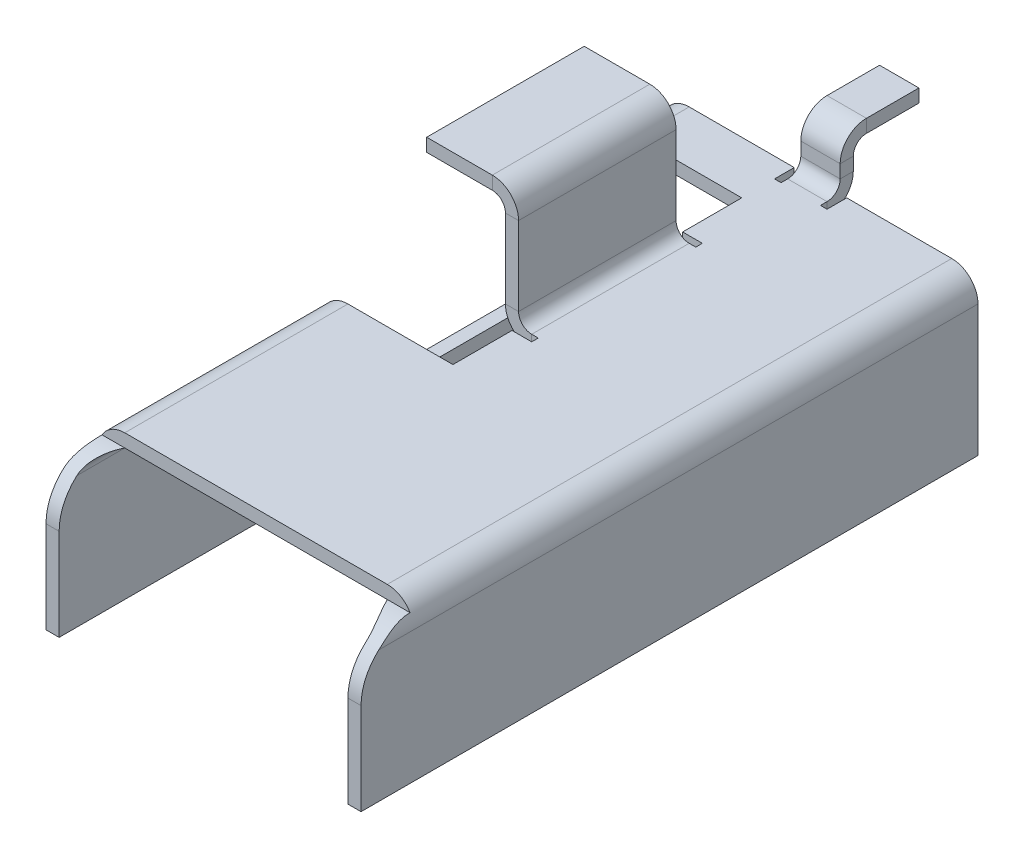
ISO-10303-21;
HEADER;
FILE_DESCRIPTION(('STEP AP214'),'2;1');
FILE_NAME('part.step','',(''),(''),'','','');
FILE_SCHEMA(('AUTOMOTIVE_DESIGN { 1 0 10303 214 1 1 1 1 }'));
ENDSEC;
DATA;
#1=APPLICATION_CONTEXT('core data for automotive mechanical design processes');
#2=APPLICATION_PROTOCOL_DEFINITION('international standard','automotive_design',2000,#1);
#3=PRODUCT_CONTEXT('',#1,'mechanical');
#4=PRODUCT('Part','Part','',(#3));
#5=PRODUCT_RELATED_PRODUCT_CATEGORY('part','',(#4));
#6=PRODUCT_DEFINITION_FORMATION('','',#4);
#7=PRODUCT_DEFINITION_CONTEXT('part definition',#1,'design');
#8=PRODUCT_DEFINITION('design','',#6,#7);
#9=PRODUCT_DEFINITION_SHAPE('','',#8);
#10=(LENGTH_UNIT() NAMED_UNIT(*) SI_UNIT(.MILLI.,.METRE.));
#11=(NAMED_UNIT(*) PLANE_ANGLE_UNIT() SI_UNIT($,.RADIAN.));
#12=(NAMED_UNIT(*) SI_UNIT($,.STERADIAN.) SOLID_ANGLE_UNIT());
#13=UNCERTAINTY_MEASURE_WITH_UNIT(LENGTH_MEASURE(1.E-05),#10,'distance_accuracy_value','');
#14=(GEOMETRIC_REPRESENTATION_CONTEXT(3) GLOBAL_UNCERTAINTY_ASSIGNED_CONTEXT((#13)) GLOBAL_UNIT_ASSIGNED_CONTEXT((#10,
#11,#12)) REPRESENTATION_CONTEXT('',''));
#15=CARTESIAN_POINT('',(0.,0.,0.));
#16=DIRECTION('',(0.,0.,1.));
#17=DIRECTION('',(1.,0.,0.));
#18=AXIS2_PLACEMENT_3D('',#15,#16,#17);
#19=CARTESIAN_POINT('',(-0.75,3.,0.));
#20=DIRECTION('',(-1.,0.,0.));
#21=DIRECTION('',(0.,0.,1.));
#22=AXIS2_PLACEMENT_3D('',#19,#20,#21);
#23=PLANE('',#22);
#24=DIRECTION('',(0.,0.,1.));
#25=VECTOR('',#24,1.);
#26=CARTESIAN_POINT('',(-0.75,8.,0.));
#27=LINE('',#26,#25);
#28=CARTESIAN_POINT('',(-0.75,8.,-3.));
#29=VERTEX_POINT('',#28);
#30=CARTESIAN_POINT('',(-0.75,8.,-1.));
#31=VERTEX_POINT('',#30);
#32=EDGE_CURVE('E826',#29,#31,#27,.T.);
#33=ORIENTED_EDGE('',*,*,#32,.F.);
#34=DIRECTION('',(0.,1.,0.));
#35=VECTOR('',#34,1.);
#36=CARTESIAN_POINT('',(-0.75,3.,-3.));
#37=LINE('',#36,#35);
#38=CARTESIAN_POINT('',(-0.75,7.5,-3.));
#39=VERTEX_POINT('',#38);
#40=EDGE_CURVE('E862',#39,#29,#37,.T.);
#41=ORIENTED_EDGE('',*,*,#40,.F.);
#42=DIRECTION('',(0.,0.,-1.));
#43=VECTOR('',#42,1.);
#44=CARTESIAN_POINT('',(-0.75,7.5,0.));
#45=LINE('',#44,#43);
#46=CARTESIAN_POINT('',(-0.750000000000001,7.5,-1.));
#47=VERTEX_POINT('',#46);
#48=EDGE_CURVE('E846',#39,#47,#45,.F.);
#49=ORIENTED_EDGE('',*,*,#48,.T.);
#50=DIRECTION('',(0.,1.,0.));
#51=VECTOR('',#50,1.);
#52=CARTESIAN_POINT('',(-0.75,3.,-1.));
#53=LINE('',#52,#51);
#54=EDGE_CURVE('E865',#47,#31,#53,.T.);
#55=ORIENTED_EDGE('',*,*,#54,.T.);
#56=EDGE_LOOP('',(#33,#41,#49,#55));
#57=FACE_BOUND('',#56,.T.);
#58=ADVANCED_FACE('F33',(#57),#23,.T.);
#59=CARTESIAN_POINT('',(0.75,3.,-3.));
#60=DIRECTION('',(0.,0.,-1.));
#61=DIRECTION('',(-1.,0.,0.));
#62=AXIS2_PLACEMENT_3D('',#59,#60,#61);
#63=PLANE('',#62);
#64=DIRECTION('',(-1.,0.,0.));
#65=VECTOR('',#64,1.);
#66=CARTESIAN_POINT('',(0.75,8.,-3.));
#67=LINE('',#66,#65);
#68=CARTESIAN_POINT('',(0.75,8.,-3.));
#69=VERTEX_POINT('',#68);
#70=EDGE_CURVE('E841',#69,#29,#67,.T.);
#71=ORIENTED_EDGE('',*,*,#70,.F.);
#72=DIRECTION('',(0.,1.,0.));
#73=VECTOR('',#72,1.);
#74=CARTESIAN_POINT('',(0.75,3.,-3.));
#75=LINE('',#74,#73);
#76=CARTESIAN_POINT('',(0.75,7.5,-3.));
#77=VERTEX_POINT('',#76);
#78=EDGE_CURVE('E859',#77,#69,#75,.T.);
#79=ORIENTED_EDGE('',*,*,#78,.F.);
#80=DIRECTION('',(-1.,0.,0.));
#81=VECTOR('',#80,1.);
#82=CARTESIAN_POINT('',(0.75,7.5,-3.));
#83=LINE('',#82,#81);
#84=EDGE_CURVE('E849',#77,#39,#83,.T.);
#85=ORIENTED_EDGE('',*,*,#84,.T.);
#86=ORIENTED_EDGE('',*,*,#40,.T.);
#87=EDGE_LOOP('',(#71,#79,#85,#86));
#88=FACE_BOUND('',#87,.T.);
#89=ADVANCED_FACE('F944',(#88),#63,.T.);
#90=CARTESIAN_POINT('',(0.75,3.,0.));
#91=DIRECTION('',(-1.,0.,0.));
#92=DIRECTION('',(0.,0.,1.));
#93=AXIS2_PLACEMENT_3D('',#90,#91,#92);
#94=PLANE('',#93);
#95=ORIENTED_EDGE('',*,*,#78,.T.);
#96=DIRECTION('',(0.,0.,1.));
#97=VECTOR('',#96,1.);
#98=CARTESIAN_POINT('',(0.75,8.,0.));
#99=LINE('',#98,#97);
#100=CARTESIAN_POINT('',(0.750000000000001,8.,-1.));
#101=VERTEX_POINT('',#100);
#102=EDGE_CURVE('E838',#69,#101,#99,.T.);
#103=ORIENTED_EDGE('',*,*,#102,.T.);
#104=DIRECTION('',(0.,1.,0.));
#105=VECTOR('',#104,1.);
#106=CARTESIAN_POINT('',(0.75,3.,-1.));
#107=LINE('',#106,#105);
#108=CARTESIAN_POINT('',(0.750000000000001,7.5,-1.));
#109=VERTEX_POINT('',#108);
#110=EDGE_CURVE('E857',#109,#101,#107,.T.);
#111=ORIENTED_EDGE('',*,*,#110,.F.);
#112=DIRECTION('',(0.,0.,-1.));
#113=VECTOR('',#112,1.);
#114=CARTESIAN_POINT('',(0.75,7.5,0.));
#115=LINE('',#114,#113);
#116=EDGE_CURVE('E851',#77,#109,#115,.F.);
#117=ORIENTED_EDGE('',*,*,#116,.F.);
#118=EDGE_LOOP('',(#95,#103,#111,#117));
#119=FACE_BOUND('',#118,.T.);
#120=ADVANCED_FACE('F949',(#119),#94,.F.);
#121=CARTESIAN_POINT('',(0.75,7.5,0.));
#122=DIRECTION('',(0.,-1.,0.));
#123=DIRECTION('',(0.,0.,-1.));
#124=AXIS2_PLACEMENT_3D('',#121,#122,#123);
#125=PLANE('',#124);
#126=DIRECTION('',(1.,0.,0.));
#127=VECTOR('',#126,1.);
#128=CARTESIAN_POINT('',(-0.75,7.5,-1.));
#129=LINE('',#128,#127);
#130=EDGE_CURVE('E854',#47,#109,#129,.T.);
#131=ORIENTED_EDGE('',*,*,#130,.F.);
#132=ORIENTED_EDGE('',*,*,#48,.F.);
#133=ORIENTED_EDGE('',*,*,#84,.F.);
#134=ORIENTED_EDGE('',*,*,#116,.T.);
#135=EDGE_LOOP('',(#131,#132,#133,#134));
#136=FACE_BOUND('',#135,.T.);
#137=ADVANCED_FACE('F960',(#136),#125,.T.);
#138=CARTESIAN_POINT('',(0.75,8.,0.));
#139=DIRECTION('',(0.,-1.,0.));
#140=DIRECTION('',(0.,0.,-1.));
#141=AXIS2_PLACEMENT_3D('',#138,#139,#140);
#142=PLANE('',#141);
#143=ORIENTED_EDGE('',*,*,#32,.T.);
#144=DIRECTION('',(1.,0.,0.));
#145=VECTOR('',#144,1.);
#146=CARTESIAN_POINT('',(-0.75,8.,-1.));
#147=LINE('',#146,#145);
#148=EDGE_CURVE('E843',#31,#101,#147,.T.);
#149=ORIENTED_EDGE('',*,*,#148,.T.);
#150=ORIENTED_EDGE('',*,*,#102,.F.);
#151=ORIENTED_EDGE('',*,*,#70,.T.);
#152=EDGE_LOOP('',(#143,#149,#150,#151));
#153=FACE_BOUND('',#152,.T.);
#154=ADVANCED_FACE('F1683',(#153),#142,.F.);
#155=CARTESIAN_POINT('',(-0.999999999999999,-2.5,10.5));
#156=DIRECTION('',(0.,0.,-1.));
#157=DIRECTION('',(-1.,0.,0.));
#158=AXIS2_PLACEMENT_3D('',#155,#156,#157);
#159=PLANE('',#158);
#160=DIRECTION('',(0.,1.,0.));
#161=VECTOR('',#160,1.);
#162=CARTESIAN_POINT('',(-4.5,-2.5,10.5));
#163=LINE('',#162,#161);
#164=CARTESIAN_POINT('',(-4.5,10.,10.5));
#165=VERTEX_POINT('',#164);
#166=CARTESIAN_POINT('',(-4.5,10.5,10.5));
#167=VERTEX_POINT('',#166);
#168=EDGE_CURVE('E817',#165,#167,#163,.T.);
#169=ORIENTED_EDGE('',*,*,#168,.F.);
#170=DIRECTION('',(1.,0.,0.));
#171=VECTOR('',#170,1.);
#172=CARTESIAN_POINT('',(-0.999999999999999,10.,10.5));
#173=LINE('',#172,#171);
#174=CARTESIAN_POINT('',(-2.,10.,10.5));
#175=VERTEX_POINT('',#174);
#176=EDGE_CURVE('E822',#175,#165,#173,.F.);
#177=ORIENTED_EDGE('',*,*,#176,.F.);
#178=DIRECTION('',(0.,1.,0.));
#179=VECTOR('',#178,1.);
#180=CARTESIAN_POINT('',(-2.,-2.5,10.5));
#181=LINE('',#180,#179);
#182=CARTESIAN_POINT('',(-2.,10.5,10.5));
#183=VERTEX_POINT('',#182);
#184=EDGE_CURVE('E803',#175,#183,#181,.T.);
#185=ORIENTED_EDGE('',*,*,#184,.T.);
#186=DIRECTION('',(-1.,0.,0.));
#187=VECTOR('',#186,1.);
#188=CARTESIAN_POINT('',(-0.999999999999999,10.5,10.5));
#189=LINE('',#188,#187);
#190=EDGE_CURVE('E816',#183,#167,#189,.T.);
#191=ORIENTED_EDGE('',*,*,#190,.T.);
#192=EDGE_LOOP('',(#169,#177,#185,#191));
#193=FACE_BOUND('',#192,.T.);
#194=ADVANCED_FACE('F1095',(#193),#159,.F.);
#195=CARTESIAN_POINT('',(-4.5,-2.5,10.5));
#196=DIRECTION('',(1.,0.,0.));
#197=DIRECTION('',(0.,0.,-1.));
#198=AXIS2_PLACEMENT_3D('',#195,#196,#197);
#199=PLANE('',#198);
#200=ORIENTED_EDGE('',*,*,#168,.T.);
#201=DIRECTION('',(0.,0.,-1.));
#202=VECTOR('',#201,1.);
#203=CARTESIAN_POINT('',(-4.5,10.5,10.5));
#204=LINE('',#203,#202);
#205=CARTESIAN_POINT('',(-4.5,10.5,4.5));
#206=VERTEX_POINT('',#205);
#207=EDGE_CURVE('E813',#167,#206,#204,.T.);
#208=ORIENTED_EDGE('',*,*,#207,.T.);
#209=DIRECTION('',(0.,1.,0.));
#210=VECTOR('',#209,1.);
#211=CARTESIAN_POINT('',(-4.5,-2.5,4.5));
#212=LINE('',#211,#210);
#213=CARTESIAN_POINT('',(-4.5,10.,4.5));
#214=VERTEX_POINT('',#213);
#215=EDGE_CURVE('E812',#214,#206,#212,.T.);
#216=ORIENTED_EDGE('',*,*,#215,.F.);
#217=DIRECTION('',(0.,0.,-1.));
#218=VECTOR('',#217,1.);
#219=CARTESIAN_POINT('',(-4.5,10.,10.5));
#220=LINE('',#219,#218);
#221=EDGE_CURVE('E827',#165,#214,#220,.T.);
#222=ORIENTED_EDGE('',*,*,#221,.F.);
#223=EDGE_LOOP('',(#200,#208,#216,#222));
#224=FACE_BOUND('',#223,.T.);
#225=ADVANCED_FACE('F1664',(#224),#199,.F.);
#226=CARTESIAN_POINT('',(-0.999999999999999,-2.5,4.5));
#227=DIRECTION('',(0.,0.,-1.));
#228=DIRECTION('',(-1.,0.,0.));
#229=AXIS2_PLACEMENT_3D('',#226,#227,#228);
#230=PLANE('',#229);
#231=DIRECTION('',(-1.,0.,0.));
#232=VECTOR('',#231,1.);
#233=CARTESIAN_POINT('',(-0.999999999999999,10.,4.5));
#234=LINE('',#233,#232);
#235=CARTESIAN_POINT('',(-2.,10.,4.5));
#236=VERTEX_POINT('',#235);
#237=EDGE_CURVE('E810',#236,#214,#234,.T.);
#238=ORIENTED_EDGE('',*,*,#237,.T.);
#239=ORIENTED_EDGE('',*,*,#215,.T.);
#240=DIRECTION('',(-1.,0.,0.));
#241=VECTOR('',#240,1.);
#242=CARTESIAN_POINT('',(-0.999999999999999,10.5,4.5));
#243=LINE('',#242,#241);
#244=CARTESIAN_POINT('',(-2.,10.5,4.5));
#245=VERTEX_POINT('',#244);
#246=EDGE_CURVE('E806',#245,#206,#243,.T.);
#247=ORIENTED_EDGE('',*,*,#246,.F.);
#248=DIRECTION('',(0.,1.,0.));
#249=VECTOR('',#248,1.);
#250=CARTESIAN_POINT('',(-2.,-2.5,4.5));
#251=LINE('',#250,#249);
#252=EDGE_CURVE('E808',#236,#245,#251,.T.);
#253=ORIENTED_EDGE('',*,*,#252,.F.);
#254=EDGE_LOOP('',(#238,#239,#247,#253));
#255=FACE_BOUND('',#254,.T.);
#256=ADVANCED_FACE('F1084',(#255),#230,.T.);
#257=CARTESIAN_POINT('',(-0.999999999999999,10.,10.5));
#258=DIRECTION('',(0.,-1.,0.));
#259=DIRECTION('',(0.,0.,-1.));
#260=AXIS2_PLACEMENT_3D('',#257,#258,#259);
#261=PLANE('',#260);
#262=ORIENTED_EDGE('',*,*,#176,.T.);
#263=ORIENTED_EDGE('',*,*,#221,.T.);
#264=ORIENTED_EDGE('',*,*,#237,.F.);
#265=DIRECTION('',(0.,0.,-1.));
#266=VECTOR('',#265,1.);
#267=CARTESIAN_POINT('',(-2.,10.,10.5));
#268=LINE('',#267,#266);
#269=EDGE_CURVE('E824',#175,#236,#268,.T.);
#270=ORIENTED_EDGE('',*,*,#269,.F.);
#271=EDGE_LOOP('',(#262,#263,#264,#270));
#272=FACE_BOUND('',#271,.T.);
#273=ADVANCED_FACE('F1078',(#272),#261,.T.);
#274=CARTESIAN_POINT('',(-0.999999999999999,10.5,10.5));
#275=DIRECTION('',(0.,-1.,0.));
#276=DIRECTION('',(0.,0.,-1.));
#277=AXIS2_PLACEMENT_3D('',#274,#275,#276);
#278=PLANE('',#277);
#279=ORIENTED_EDGE('',*,*,#207,.F.);
#280=ORIENTED_EDGE('',*,*,#190,.F.);
#281=DIRECTION('',(0.,0.,-1.));
#282=VECTOR('',#281,1.);
#283=CARTESIAN_POINT('',(-2.,10.5,10.5));
#284=LINE('',#283,#282);
#285=EDGE_CURVE('E809',#183,#245,#284,.T.);
#286=ORIENTED_EDGE('',*,*,#285,.T.);
#287=ORIENTED_EDGE('',*,*,#246,.T.);
#288=EDGE_LOOP('',(#279,#280,#286,#287));
#289=FACE_BOUND('',#288,.T.);
#290=ADVANCED_FACE('F1087',(#289),#278,.F.);
#291=CARTESIAN_POINT('',(12.4164078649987,5.5,10.5));
#292=DIRECTION('',(0.,0.,1.));
#293=DIRECTION('',(0.,-1.,0.));
#294=AXIS2_PLACEMENT_3D('',#291,#292,#293);
#295=PLANE('',#294);
#296=DIRECTION('',(-1.,0.,0.));
#297=VECTOR('',#296,1.);
#298=CARTESIAN_POINT('',(12.4164078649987,9.5,10.5));
#299=LINE('',#298,#297);
#300=CARTESIAN_POINT('',(-1.,9.5,10.5));
#301=VERTEX_POINT('',#300);
#302=CARTESIAN_POINT('',(-1.5,9.5,10.5));
#303=VERTEX_POINT('',#302);
#304=EDGE_CURVE('E773',#301,#303,#299,.T.);
#305=ORIENTED_EDGE('',*,*,#304,.T.);
#306=DIRECTION('',(0.,1.,0.));
#307=VECTOR('',#306,1.);
#308=CARTESIAN_POINT('',(-1.5,5.5,10.5));
#309=LINE('',#308,#307);
#310=CARTESIAN_POINT('',(-1.5,6.5,10.5));
#311=VERTEX_POINT('',#310);
#312=EDGE_CURVE('E777',#311,#303,#309,.T.);
#313=ORIENTED_EDGE('',*,*,#312,.F.);
#314=DIRECTION('',(-1.,0.,0.));
#315=VECTOR('',#314,1.);
#316=CARTESIAN_POINT('',(12.4164078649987,6.5,10.5));
#317=LINE('',#316,#315);
#318=CARTESIAN_POINT('',(-1.,6.5,10.5));
#319=VERTEX_POINT('',#318);
#320=EDGE_CURVE('E785',#319,#311,#317,.T.);
#321=ORIENTED_EDGE('',*,*,#320,.F.);
#322=DIRECTION('',(0.,1.,0.));
#323=VECTOR('',#322,1.);
#324=CARTESIAN_POINT('',(-1.,5.5,10.5));
#325=LINE('',#324,#323);
#326=EDGE_CURVE('E783',#319,#301,#325,.T.);
#327=ORIENTED_EDGE('',*,*,#326,.T.);
#328=EDGE_LOOP('',(#305,#313,#321,#327));
#329=FACE_BOUND('',#328,.T.);
#330=ADVANCED_FACE('F1050',(#329),#295,.T.);
#331=CARTESIAN_POINT('',(12.4164078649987,5.5,4.5));
#332=DIRECTION('',(0.,0.,1.));
#333=DIRECTION('',(0.,-1.,0.));
#334=AXIS2_PLACEMENT_3D('',#331,#332,#333);
#335=PLANE('',#334);
#336=DIRECTION('',(0.,-1.,0.));
#337=VECTOR('',#336,1.);
#338=CARTESIAN_POINT('',(-1.5,5.5,4.5));
#339=LINE('',#338,#337);
#340=CARTESIAN_POINT('',(-1.5,9.5,4.5));
#341=VERTEX_POINT('',#340);
#342=CARTESIAN_POINT('',(-1.5,6.5,4.5));
#343=VERTEX_POINT('',#342);
#344=EDGE_CURVE('E774',#341,#343,#339,.T.);
#345=ORIENTED_EDGE('',*,*,#344,.F.);
#346=DIRECTION('',(-1.,0.,0.));
#347=VECTOR('',#346,1.);
#348=CARTESIAN_POINT('',(12.4164078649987,9.5,4.5));
#349=LINE('',#348,#347);
#350=CARTESIAN_POINT('',(-1.,9.5,4.5));
#351=VERTEX_POINT('',#350);
#352=EDGE_CURVE('E792',#351,#341,#349,.T.);
#353=ORIENTED_EDGE('',*,*,#352,.F.);
#354=DIRECTION('',(0.,-1.,0.));
#355=VECTOR('',#354,1.);
#356=CARTESIAN_POINT('',(-1.,5.5,4.5));
#357=LINE('',#356,#355);
#358=CARTESIAN_POINT('',(-1.,6.5,4.5));
#359=VERTEX_POINT('',#358);
#360=EDGE_CURVE('E779',#351,#359,#357,.T.);
#361=ORIENTED_EDGE('',*,*,#360,.T.);
#362=DIRECTION('',(-1.,0.,0.));
#363=VECTOR('',#362,1.);
#364=CARTESIAN_POINT('',(12.4164078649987,6.5,4.5));
#365=LINE('',#364,#363);
#366=EDGE_CURVE('E782',#359,#343,#365,.T.);
#367=ORIENTED_EDGE('',*,*,#366,.T.);
#368=EDGE_LOOP('',(#345,#353,#361,#367));
#369=FACE_BOUND('',#368,.T.);
#370=ADVANCED_FACE('F1063',(#369),#335,.F.);
#371=CARTESIAN_POINT('',(-1.,5.5,10.5));
#372=DIRECTION('',(-1.,0.,0.));
#373=DIRECTION('',(0.,0.,1.));
#374=AXIS2_PLACEMENT_3D('',#371,#372,#373);
#375=PLANE('',#374);
#376=ORIENTED_EDGE('',*,*,#360,.F.);
#377=DIRECTION('',(0.,0.,1.));
#378=VECTOR('',#377,1.);
#379=CARTESIAN_POINT('',(-1.,9.5,10.5));
#380=LINE('',#379,#378);
#381=EDGE_CURVE('E791',#351,#301,#380,.T.);
#382=ORIENTED_EDGE('',*,*,#381,.T.);
#383=ORIENTED_EDGE('',*,*,#326,.F.);
#384=DIRECTION('',(0.,0.,-1.));
#385=VECTOR('',#384,1.);
#386=CARTESIAN_POINT('',(-1.,6.5,4.5));
#387=LINE('',#386,#385);
#388=EDGE_CURVE('E778',#319,#359,#387,.T.);
#389=ORIENTED_EDGE('',*,*,#388,.T.);
#390=EDGE_LOOP('',(#376,#382,#383,#389));
#391=FACE_BOUND('',#390,.T.);
#392=ADVANCED_FACE('F1045',(#391),#375,.F.);
#393=CARTESIAN_POINT('',(-1.5,5.5,10.5));
#394=DIRECTION('',(-1.,0.,0.));
#395=DIRECTION('',(0.,0.,1.));
#396=AXIS2_PLACEMENT_3D('',#393,#394,#395);
#397=PLANE('',#396);
#398=DIRECTION('',(0.,0.,1.));
#399=VECTOR('',#398,1.);
#400=CARTESIAN_POINT('',(-1.5,9.5,10.5));
#401=LINE('',#400,#399);
#402=EDGE_CURVE('E788',#341,#303,#401,.T.);
#403=ORIENTED_EDGE('',*,*,#402,.F.);
#404=ORIENTED_EDGE('',*,*,#344,.T.);
#405=DIRECTION('',(0.,0.,-1.));
#406=VECTOR('',#405,1.);
#407=CARTESIAN_POINT('',(-1.5,6.5,4.5));
#408=LINE('',#407,#406);
#409=EDGE_CURVE('E787',#311,#343,#408,.T.);
#410=ORIENTED_EDGE('',*,*,#409,.F.);
#411=ORIENTED_EDGE('',*,*,#312,.T.);
#412=EDGE_LOOP('',(#403,#404,#410,#411));
#413=FACE_BOUND('',#412,.T.);
#414=ADVANCED_FACE('F1066',(#413),#397,.T.);
#415=CARTESIAN_POINT('',(-0.75,8.,3.16227766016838));
#416=DIRECTION('',(1.,0.,0.));
#417=DIRECTION('',(0.,1.,0.));
#418=AXIS2_PLACEMENT_3D('',#415,#416,#417);
#419=PLANE('',#418);
#420=DIRECTION('',(0.,-1.,0.));
#421=VECTOR('',#420,1.);
#422=CARTESIAN_POINT('',(-0.75,8.,-0.5));
#423=LINE('',#422,#421);
#424=CARTESIAN_POINT('',(-0.75,7.,-0.5));
#425=VERTEX_POINT('',#424);
#426=CARTESIAN_POINT('',(-0.750000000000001,6.5,-0.5));
#427=VERTEX_POINT('',#426);
#428=EDGE_CURVE('E740',#425,#427,#423,.T.);
#429=ORIENTED_EDGE('',*,*,#428,.T.);
#430=DIRECTION('',(0.,0.,-1.));
#431=VECTOR('',#430,1.);
#432=CARTESIAN_POINT('',(-0.75,6.5,3.16227766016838));
#433=LINE('',#432,#431);
#434=CARTESIAN_POINT('',(-0.750000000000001,6.5,0.));
#435=VERTEX_POINT('',#434);
#436=EDGE_CURVE('E763',#435,#427,#433,.T.);
#437=ORIENTED_EDGE('',*,*,#436,.F.);
#438=DIRECTION('',(0.,-1.,0.));
#439=VECTOR('',#438,1.);
#440=CARTESIAN_POINT('',(-0.75,8.,0.));
#441=LINE('',#440,#439);
#442=CARTESIAN_POINT('',(-0.75,7.,0.));
#443=VERTEX_POINT('',#442);
#444=EDGE_CURVE('E748',#443,#435,#441,.T.);
#445=ORIENTED_EDGE('',*,*,#444,.F.);
#446=DIRECTION('',(0.,0.,-1.));
#447=VECTOR('',#446,1.);
#448=CARTESIAN_POINT('',(-0.75,7.,3.16227766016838));
#449=LINE('',#448,#447);
#450=EDGE_CURVE('E765',#443,#425,#449,.T.);
#451=ORIENTED_EDGE('',*,*,#450,.T.);
#452=EDGE_LOOP('',(#429,#437,#445,#451));
#453=FACE_BOUND('',#452,.T.);
#454=ADVANCED_FACE('F980',(#453),#419,.F.);
#455=CARTESIAN_POINT('',(0.75,8.,3.16227766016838));
#456=DIRECTION('',(1.,0.,0.));
#457=DIRECTION('',(0.,1.,0.));
#458=AXIS2_PLACEMENT_3D('',#455,#456,#457);
#459=PLANE('',#458);
#460=DIRECTION('',(0.,0.,-1.));
#461=VECTOR('',#460,1.);
#462=CARTESIAN_POINT('',(0.75,6.5,3.16227766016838));
#463=LINE('',#462,#461);
#464=CARTESIAN_POINT('',(0.750000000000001,6.5,0.));
#465=VERTEX_POINT('',#464);
#466=CARTESIAN_POINT('',(0.75,6.5,-0.5));
#467=VERTEX_POINT('',#466);
#468=EDGE_CURVE('E760',#465,#467,#463,.T.);
#469=ORIENTED_EDGE('',*,*,#468,.T.);
#470=DIRECTION('',(0.,1.,0.));
#471=VECTOR('',#470,1.);
#472=CARTESIAN_POINT('',(0.75,8.,-0.5));
#473=LINE('',#472,#471);
#474=CARTESIAN_POINT('',(0.750000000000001,7.,-0.500000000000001));
#475=VERTEX_POINT('',#474);
#476=EDGE_CURVE('E771',#467,#475,#473,.T.);
#477=ORIENTED_EDGE('',*,*,#476,.T.);
#478=DIRECTION('',(0.,0.,-1.));
#479=VECTOR('',#478,1.);
#480=CARTESIAN_POINT('',(0.75,7.,3.16227766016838));
#481=LINE('',#480,#479);
#482=CARTESIAN_POINT('',(0.75,7.,0.));
#483=VERTEX_POINT('',#482);
#484=EDGE_CURVE('E757',#483,#475,#481,.T.);
#485=ORIENTED_EDGE('',*,*,#484,.F.);
#486=DIRECTION('',(0.,1.,0.));
#487=VECTOR('',#486,1.);
#488=CARTESIAN_POINT('',(0.75,8.,0.));
#489=LINE('',#488,#487);
#490=EDGE_CURVE('E768',#465,#483,#489,.T.);
#491=ORIENTED_EDGE('',*,*,#490,.F.);
#492=EDGE_LOOP('',(#469,#477,#485,#491));
#493=FACE_BOUND('',#492,.T.);
#494=ADVANCED_FACE('F988',(#493),#459,.T.);
#495=CARTESIAN_POINT('',(0.75,8.,0.));
#496=DIRECTION('',(0.,0.,-1.));
#497=DIRECTION('',(0.,1.,0.));
#498=AXIS2_PLACEMENT_3D('',#495,#496,#497);
#499=PLANE('',#498);
#500=ORIENTED_EDGE('',*,*,#490,.T.);
#501=DIRECTION('',(-1.,0.,0.));
#502=VECTOR('',#501,1.);
#503=CARTESIAN_POINT('',(-0.75,7.,0.));
#504=LINE('',#503,#502);
#505=EDGE_CURVE('E754',#483,#443,#504,.T.);
#506=ORIENTED_EDGE('',*,*,#505,.T.);
#507=ORIENTED_EDGE('',*,*,#444,.T.);
#508=DIRECTION('',(1.,0.,0.));
#509=VECTOR('',#508,1.);
#510=CARTESIAN_POINT('',(0.75,6.5,0.));
#511=LINE('',#510,#509);
#512=EDGE_CURVE('E751',#435,#465,#511,.T.);
#513=ORIENTED_EDGE('',*,*,#512,.T.);
#514=EDGE_LOOP('',(#500,#506,#507,#513));
#515=FACE_BOUND('',#514,.T.);
#516=ADVANCED_FACE('F975',(#515),#499,.F.);
#517=CARTESIAN_POINT('',(0.75,8.,-0.5));
#518=DIRECTION('',(0.,0.,-1.));
#519=DIRECTION('',(0.,1.,0.));
#520=AXIS2_PLACEMENT_3D('',#517,#518,#519);
#521=PLANE('',#520);
#522=DIRECTION('',(-1.,0.,0.));
#523=VECTOR('',#522,1.);
#524=CARTESIAN_POINT('',(-0.75,7.,-0.5));
#525=LINE('',#524,#523);
#526=EDGE_CURVE('E745',#475,#425,#525,.T.);
#527=ORIENTED_EDGE('',*,*,#526,.F.);
#528=ORIENTED_EDGE('',*,*,#476,.F.);
#529=DIRECTION('',(1.,0.,0.));
#530=VECTOR('',#529,1.);
#531=CARTESIAN_POINT('',(0.75,6.5,-0.5));
#532=LINE('',#531,#530);
#533=EDGE_CURVE('E743',#427,#467,#532,.T.);
#534=ORIENTED_EDGE('',*,*,#533,.F.);
#535=ORIENTED_EDGE('',*,*,#428,.F.);
#536=EDGE_LOOP('',(#527,#528,#534,#535));
#537=FACE_BOUND('',#536,.T.);
#538=ADVANCED_FACE('F985',(#537),#521,.T.);
#539=CARTESIAN_POINT('',(-42.0520551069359,6.00000000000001,0.));
#540=DIRECTION('',(0.,0.,1.));
#541=DIRECTION('',(0.,-1.,0.));
#542=AXIS2_PLACEMENT_3D('',#539,#540,#541);
#543=PLANE('',#542);
#544=DIRECTION('',(0.,-1.,0.));
#545=VECTOR('',#544,1.);
#546=CARTESIAN_POINT('',(6.,6.,0.));
#547=LINE('',#546,#545);
#548=CARTESIAN_POINT('',(6.,5.,0.));
#549=VERTEX_POINT('',#548);
#550=CARTESIAN_POINT('',(6.,0.,0.));
#551=VERTEX_POINT('',#550);
#552=EDGE_CURVE('E711',#549,#551,#547,.T.);
#553=ORIENTED_EDGE('',*,*,#552,.T.);
#554=DIRECTION('',(1.,0.,0.));
#555=VECTOR('',#554,1.);
#556=CARTESIAN_POINT('',(-42.0520551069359,0.,0.));
#557=LINE('',#556,#555);
#558=CARTESIAN_POINT('',(5.5,0.,0.));
#559=VERTEX_POINT('',#558);
#560=EDGE_CURVE('E728',#559,#551,#557,.T.);
#561=ORIENTED_EDGE('',*,*,#560,.F.);
#562=DIRECTION('',(0.,-1.,0.));
#563=VECTOR('',#562,1.);
#564=CARTESIAN_POINT('',(5.5,6.,0.));
#565=LINE('',#564,#563);
#566=CARTESIAN_POINT('',(5.5,5.,0.));
#567=VERTEX_POINT('',#566);
#568=EDGE_CURVE('E718',#567,#559,#565,.T.);
#569=ORIENTED_EDGE('',*,*,#568,.F.);
#570=DIRECTION('',(1.,0.,0.));
#571=VECTOR('',#570,1.);
#572=CARTESIAN_POINT('',(-42.0520551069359,5.00000000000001,0.));
#573=LINE('',#572,#571);
#574=EDGE_CURVE('E731',#567,#549,#573,.T.);
#575=ORIENTED_EDGE('',*,*,#574,.T.);
#576=EDGE_LOOP('',(#553,#561,#569,#575));
#577=FACE_BOUND('',#576,.T.);
#578=ADVANCED_FACE('F1565',(#577),#543,.F.);
#579=CARTESIAN_POINT('',(-42.0520551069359,0.,23.5));
#580=DIRECTION('',(0.,-1.,0.));
#581=DIRECTION('',(1.,0.,0.));
#582=AXIS2_PLACEMENT_3D('',#579,#580,#581);
#583=PLANE('',#582);
#584=ORIENTED_EDGE('',*,*,#560,.T.);
#585=DIRECTION('',(0.,0.,-1.));
#586=VECTOR('',#585,1.);
#587=CARTESIAN_POINT('',(6.,0.,23.5));
#588=LINE('',#587,#586);
#589=CARTESIAN_POINT('',(6.,0.,23.5));
#590=VERTEX_POINT('',#589);
#591=EDGE_CURVE('E714',#590,#551,#588,.T.);
#592=ORIENTED_EDGE('',*,*,#591,.F.);
#593=DIRECTION('',(1.,0.,0.));
#594=VECTOR('',#593,1.);
#595=CARTESIAN_POINT('',(-42.0520551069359,0.,23.5));
#596=LINE('',#595,#594);
#597=CARTESIAN_POINT('',(5.5,0.,23.5));
#598=VERTEX_POINT('',#597);
#599=EDGE_CURVE('E725',#598,#590,#596,.T.);
#600=ORIENTED_EDGE('',*,*,#599,.F.);
#601=DIRECTION('',(0.,0.,-1.));
#602=VECTOR('',#601,1.);
#603=CARTESIAN_POINT('',(5.5,0.,23.5));
#604=LINE('',#603,#602);
#605=EDGE_CURVE('E721',#598,#559,#604,.T.);
#606=ORIENTED_EDGE('',*,*,#605,.T.);
#607=EDGE_LOOP('',(#584,#592,#600,#606));
#608=FACE_BOUND('',#607,.T.);
#609=ADVANCED_FACE('F1556',(#608),#583,.T.);
#610=CARTESIAN_POINT('',(-42.0520551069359,6.00000000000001,23.5));
#611=DIRECTION('',(0.,0.,1.));
#612=DIRECTION('',(0.,-1.,0.));
#613=AXIS2_PLACEMENT_3D('',#610,#611,#612);
#614=PLANE('',#613);
#615=DIRECTION('',(0.,1.,0.));
#616=VECTOR('',#615,1.);
#617=CARTESIAN_POINT('',(6.,6.,23.5));
#618=LINE('',#617,#616);
#619=CARTESIAN_POINT('',(6.,3.5,23.5));
#620=VERTEX_POINT('',#619);
#621=EDGE_CURVE('E737',#590,#620,#618,.T.);
#622=ORIENTED_EDGE('',*,*,#621,.T.);
#623=DIRECTION('',(-1.,0.,0.));
#624=VECTOR('',#623,1.);
#625=CARTESIAN_POINT('',(-42.0520551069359,3.5,23.5));
#626=LINE('',#625,#624);
#627=CARTESIAN_POINT('',(5.5,3.5,23.5));
#628=VERTEX_POINT('',#627);
#629=EDGE_CURVE('E868',#620,#628,#626,.T.);
#630=ORIENTED_EDGE('',*,*,#629,.T.);
#631=DIRECTION('',(0.,1.,0.));
#632=VECTOR('',#631,1.);
#633=CARTESIAN_POINT('',(5.5,6.,23.5));
#634=LINE('',#633,#632);
#635=EDGE_CURVE('E734',#598,#628,#634,.T.);
#636=ORIENTED_EDGE('',*,*,#635,.F.);
#637=ORIENTED_EDGE('',*,*,#599,.T.);
#638=EDGE_LOOP('',(#622,#630,#636,#637));
#639=FACE_BOUND('',#638,.T.);
#640=ADVANCED_FACE('F1547',(#639),#614,.T.);
#641=CARTESIAN_POINT('',(5.5,6.,23.5));
#642=DIRECTION('',(1.,0.,0.));
#643=DIRECTION('',(0.,1.,0.));
#644=AXIS2_PLACEMENT_3D('',#641,#642,#643);
#645=PLANE('',#644);
#646=ORIENTED_EDGE('',*,*,#635,.T.);
#647=CARTESIAN_POINT('',(5.5,3.5,21.5));
#648=DIRECTION('',(1.,0.,0.));
#649=DIRECTION('',(0.,1.,0.));
#650=AXIS2_PLACEMENT_3D('',#647,#648,#649);
#651=CIRCLE('',#650,2.);
#652=CARTESIAN_POINT('',(5.5,5.,22.8228756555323));
#653=VERTEX_POINT('',#652);
#654=EDGE_CURVE('E871',#628,#653,#651,.F.);
#655=ORIENTED_EDGE('',*,*,#654,.T.);
#656=DIRECTION('',(0.,0.,-1.));
#657=VECTOR('',#656,1.);
#658=CARTESIAN_POINT('',(5.5,5.,0.));
#659=LINE('',#658,#657);
#660=EDGE_CURVE('E723',#653,#567,#659,.T.);
#661=ORIENTED_EDGE('',*,*,#660,.T.);
#662=ORIENTED_EDGE('',*,*,#568,.T.);
#663=ORIENTED_EDGE('',*,*,#605,.F.);
#664=EDGE_LOOP('',(#646,#655,#661,#662,#663));
#665=FACE_BOUND('',#664,.T.);
#666=ADVANCED_FACE('F1538',(#665),#645,.F.);
#667=CARTESIAN_POINT('',(6.,6.,23.5));
#668=DIRECTION('',(1.,0.,0.));
#669=DIRECTION('',(0.,1.,0.));
#670=AXIS2_PLACEMENT_3D('',#667,#668,#669);
#671=PLANE('',#670);
#672=DIRECTION('',(0.,0.,-1.));
#673=VECTOR('',#672,1.);
#674=CARTESIAN_POINT('',(6.,5.,0.));
#675=LINE('',#674,#673);
#676=CARTESIAN_POINT('',(6.,5.,22.8228756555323));
#677=VERTEX_POINT('',#676);
#678=EDGE_CURVE('E716',#677,#549,#675,.T.);
#679=ORIENTED_EDGE('',*,*,#678,.F.);
#680=CARTESIAN_POINT('',(6.,3.5,21.5));
#681=DIRECTION('',(1.,0.,0.));
#682=DIRECTION('',(0.,1.,0.));
#683=AXIS2_PLACEMENT_3D('',#680,#681,#682);
#684=CIRCLE('',#683,2.);
#685=EDGE_CURVE('E1809',#677,#620,#684,.T.);
#686=ORIENTED_EDGE('',*,*,#685,.T.);
#687=ORIENTED_EDGE('',*,*,#621,.F.);
#688=ORIENTED_EDGE('',*,*,#591,.T.);
#689=ORIENTED_EDGE('',*,*,#552,.F.);
#690=EDGE_LOOP('',(#679,#686,#687,#688,#689));
#691=FACE_BOUND('',#690,.T.);
#692=ADVANCED_FACE('F1529',(#691),#671,.T.);
#693=CARTESIAN_POINT('',(42.0520551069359,0.,2.));
#694=DIRECTION('',(0.,0.,-1.));
#695=DIRECTION('',(0.,-1.,0.));
#696=AXIS2_PLACEMENT_3D('',#693,#694,#695);
#697=PLANE('',#696);
#698=DIRECTION('',(0.,1.,0.));
#699=VECTOR('',#698,1.);
#700=CARTESIAN_POINT('',(-6.,2.,2.));
#701=LINE('',#700,#699);
#702=CARTESIAN_POINT('',(-6.,2.,2.));
#703=VERTEX_POINT('',#702);
#704=CARTESIAN_POINT('',(-6.,5.,2.));
#705=VERTEX_POINT('',#704);
#706=EDGE_CURVE('E653',#703,#705,#701,.T.);
#707=ORIENTED_EDGE('',*,*,#706,.F.);
#708=DIRECTION('',(-1.,0.,0.));
#709=VECTOR('',#708,1.);
#710=CARTESIAN_POINT('',(42.0520551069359,1.99999999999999,2.));
#711=LINE('',#710,#709);
#712=CARTESIAN_POINT('',(-5.5,2.,2.));
#713=VERTEX_POINT('',#712);
#714=EDGE_CURVE('E705',#713,#703,#711,.T.);
#715=ORIENTED_EDGE('',*,*,#714,.F.);
#716=DIRECTION('',(0.,-1.,0.));
#717=VECTOR('',#716,1.);
#718=CARTESIAN_POINT('',(-5.5,0.,2.));
#719=LINE('',#718,#717);
#720=CARTESIAN_POINT('',(-5.5,5.,2.));
#721=VERTEX_POINT('',#720);
#722=EDGE_CURVE('E673',#721,#713,#719,.T.);
#723=ORIENTED_EDGE('',*,*,#722,.F.);
#724=DIRECTION('',(-1.,0.,0.));
#725=VECTOR('',#724,1.);
#726=CARTESIAN_POINT('',(42.0520551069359,4.99999999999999,2.));
#727=LINE('',#726,#725);
#728=EDGE_CURVE('E708',#721,#705,#727,.T.);
#729=ORIENTED_EDGE('',*,*,#728,.T.);
#730=EDGE_LOOP('',(#707,#715,#723,#729));
#731=FACE_BOUND('',#730,.T.);
#732=ADVANCED_FACE('F1520',(#731),#697,.F.);
#733=CARTESIAN_POINT('',(42.0520551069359,1.99999999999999,23.5));
#734=DIRECTION('',(0.,-1.,0.));
#735=DIRECTION('',(0.,0.,1.));
#736=AXIS2_PLACEMENT_3D('',#733,#734,#735);
#737=PLANE('',#736);
#738=DIRECTION('',(0.,0.,1.));
#739=VECTOR('',#738,1.);
#740=CARTESIAN_POINT('',(-6.,2.,13.));
#741=LINE('',#740,#739);
#742=CARTESIAN_POINT('',(-6.,2.,13.));
#743=VERTEX_POINT('',#742);
#744=EDGE_CURVE('E667',#703,#743,#741,.T.);
#745=ORIENTED_EDGE('',*,*,#744,.T.);
#746=DIRECTION('',(-1.,0.,0.));
#747=VECTOR('',#746,1.);
#748=CARTESIAN_POINT('',(42.0520551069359,1.99999999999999,13.));
#749=LINE('',#748,#747);
#750=CARTESIAN_POINT('',(-5.5,2.,13.));
#751=VERTEX_POINT('',#750);
#752=EDGE_CURVE('E702',#751,#743,#749,.T.);
#753=ORIENTED_EDGE('',*,*,#752,.F.);
#754=DIRECTION('',(0.,0.,1.));
#755=VECTOR('',#754,1.);
#756=CARTESIAN_POINT('',(-5.5,2.,23.5));
#757=LINE('',#756,#755);
#758=EDGE_CURVE('E675',#713,#751,#757,.T.);
#759=ORIENTED_EDGE('',*,*,#758,.F.);
#760=ORIENTED_EDGE('',*,*,#714,.T.);
#761=EDGE_LOOP('',(#745,#753,#759,#760));
#762=FACE_BOUND('',#761,.T.);
#763=ADVANCED_FACE('F1511',(#762),#737,.F.);
#764=CARTESIAN_POINT('',(42.0520551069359,0.,13.));
#765=DIRECTION('',(0.,0.,1.));
#766=DIRECTION('',(0.,1.,0.));
#767=AXIS2_PLACEMENT_3D('',#764,#765,#766);
#768=PLANE('',#767);
#769=DIRECTION('',(0.,1.,0.));
#770=VECTOR('',#769,1.);
#771=CARTESIAN_POINT('',(-6.,2.,13.));
#772=LINE('',#771,#770);
#773=CARTESIAN_POINT('',(-6.,5.,13.));
#774=VERTEX_POINT('',#773);
#775=EDGE_CURVE('E664',#743,#774,#772,.T.);
#776=ORIENTED_EDGE('',*,*,#775,.T.);
#777=DIRECTION('',(-1.,0.,0.));
#778=VECTOR('',#777,1.);
#779=CARTESIAN_POINT('',(42.0520551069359,4.99999999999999,13.));
#780=LINE('',#779,#778);
#781=CARTESIAN_POINT('',(-5.5,5.,13.));
#782=VERTEX_POINT('',#781);
#783=EDGE_CURVE('E700',#782,#774,#780,.T.);
#784=ORIENTED_EDGE('',*,*,#783,.F.);
#785=DIRECTION('',(0.,1.,0.));
#786=VECTOR('',#785,1.);
#787=CARTESIAN_POINT('',(-5.5,0.,13.));
#788=LINE('',#787,#786);
#789=EDGE_CURVE('E677',#751,#782,#788,.T.);
#790=ORIENTED_EDGE('',*,*,#789,.F.);
#791=ORIENTED_EDGE('',*,*,#752,.T.);
#792=EDGE_LOOP('',(#776,#784,#790,#791));
#793=FACE_BOUND('',#792,.T.);
#794=ADVANCED_FACE('F1502',(#793),#768,.F.);
#795=CARTESIAN_POINT('',(42.0520551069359,0.,23.5));
#796=DIRECTION('',(0.,0.,1.));
#797=DIRECTION('',(0.,1.,0.));
#798=AXIS2_PLACEMENT_3D('',#795,#796,#797);
#799=PLANE('',#798);
#800=DIRECTION('',(0.,1.,0.));
#801=VECTOR('',#800,1.);
#802=CARTESIAN_POINT('',(-5.5,0.,23.5));
#803=LINE('',#802,#801);
#804=CARTESIAN_POINT('',(-5.5,0.,23.5));
#805=VERTEX_POINT('',#804);
#806=CARTESIAN_POINT('',(-5.5,3.5,23.5));
#807=VERTEX_POINT('',#806);
#808=EDGE_CURVE('E680',#805,#807,#803,.T.);
#809=ORIENTED_EDGE('',*,*,#808,.T.);
#810=DIRECTION('',(-1.,0.,0.));
#811=VECTOR('',#810,1.);
#812=CARTESIAN_POINT('',(42.0520551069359,3.5,23.5));
#813=LINE('',#812,#811);
#814=CARTESIAN_POINT('',(-6.,3.5,23.5));
#815=VERTEX_POINT('',#814);
#816=EDGE_CURVE('E1810',#807,#815,#813,.T.);
#817=ORIENTED_EDGE('',*,*,#816,.T.);
#818=DIRECTION('',(0.,1.,0.));
#819=VECTOR('',#818,1.);
#820=CARTESIAN_POINT('',(-6.,0.,23.5));
#821=LINE('',#820,#819);
#822=CARTESIAN_POINT('',(-6.,0.,23.5));
#823=VERTEX_POINT('',#822);
#824=EDGE_CURVE('E662',#823,#815,#821,.T.);
#825=ORIENTED_EDGE('',*,*,#824,.F.);
#826=DIRECTION('',(-1.,0.,0.));
#827=VECTOR('',#826,1.);
#828=CARTESIAN_POINT('',(42.0520551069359,0.,23.5));
#829=LINE('',#828,#827);
#830=EDGE_CURVE('E697',#805,#823,#829,.T.);
#831=ORIENTED_EDGE('',*,*,#830,.F.);
#832=EDGE_LOOP('',(#809,#817,#825,#831));
#833=FACE_BOUND('',#832,.T.);
#834=ADVANCED_FACE('F1493',(#833),#799,.T.);
#835=CARTESIAN_POINT('',(42.0520551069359,0.,23.5));
#836=DIRECTION('',(0.,1.,0.));
#837=DIRECTION('',(-1.,0.,0.));
#838=AXIS2_PLACEMENT_3D('',#835,#836,#837);
#839=PLANE('',#838);
#840=DIRECTION('',(0.,0.,-1.));
#841=VECTOR('',#840,1.);
#842=CARTESIAN_POINT('',(-6.,0.,23.5));
#843=LINE('',#842,#841);
#844=CARTESIAN_POINT('',(-6.,0.,0.));
#845=VERTEX_POINT('',#844);
#846=EDGE_CURVE('E659',#823,#845,#843,.T.);
#847=ORIENTED_EDGE('',*,*,#846,.T.);
#848=DIRECTION('',(-1.,0.,0.));
#849=VECTOR('',#848,1.);
#850=CARTESIAN_POINT('',(42.0520551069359,0.,0.));
#851=LINE('',#850,#849);
#852=CARTESIAN_POINT('',(-5.5,0.,0.));
#853=VERTEX_POINT('',#852);
#854=EDGE_CURVE('E695',#853,#845,#851,.T.);
#855=ORIENTED_EDGE('',*,*,#854,.F.);
#856=DIRECTION('',(0.,0.,-1.));
#857=VECTOR('',#856,1.);
#858=CARTESIAN_POINT('',(-5.5,0.,23.5));
#859=LINE('',#858,#857);
#860=EDGE_CURVE('E683',#805,#853,#859,.T.);
#861=ORIENTED_EDGE('',*,*,#860,.F.);
#862=ORIENTED_EDGE('',*,*,#830,.T.);
#863=EDGE_LOOP('',(#847,#855,#861,#862));
#864=FACE_BOUND('',#863,.T.);
#865=ADVANCED_FACE('F1484',(#864),#839,.F.);
#866=CARTESIAN_POINT('',(42.0520551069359,0.,0.));
#867=DIRECTION('',(0.,0.,1.));
#868=DIRECTION('',(0.,1.,0.));
#869=AXIS2_PLACEMENT_3D('',#866,#867,#868);
#870=PLANE('',#869);
#871=DIRECTION('',(0.,1.,0.));
#872=VECTOR('',#871,1.);
#873=CARTESIAN_POINT('',(-6.,0.,0.));
#874=LINE('',#873,#872);
#875=CARTESIAN_POINT('',(-6.,5.,0.));
#876=VERTEX_POINT('',#875);
#877=EDGE_CURVE('E656',#845,#876,#874,.T.);
#878=ORIENTED_EDGE('',*,*,#877,.T.);
#879=DIRECTION('',(-1.,0.,0.));
#880=VECTOR('',#879,1.);
#881=CARTESIAN_POINT('',(42.0520551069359,4.99999999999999,0.));
#882=LINE('',#881,#880);
#883=CARTESIAN_POINT('',(-5.5,5.,0.));
#884=VERTEX_POINT('',#883);
#885=EDGE_CURVE('E693',#884,#876,#882,.T.);
#886=ORIENTED_EDGE('',*,*,#885,.F.);
#887=DIRECTION('',(0.,1.,0.));
#888=VECTOR('',#887,1.);
#889=CARTESIAN_POINT('',(-5.5,0.,0.));
#890=LINE('',#889,#888);
#891=EDGE_CURVE('E685',#853,#884,#890,.T.);
#892=ORIENTED_EDGE('',*,*,#891,.F.);
#893=ORIENTED_EDGE('',*,*,#854,.T.);
#894=EDGE_LOOP('',(#878,#886,#892,#893));
#895=FACE_BOUND('',#894,.T.);
#896=ADVANCED_FACE('F1475',(#895),#870,.F.);
#897=CARTESIAN_POINT('',(-5.5,0.,23.5));
#898=DIRECTION('',(-1.,0.,0.));
#899=DIRECTION('',(0.,-1.,0.));
#900=AXIS2_PLACEMENT_3D('',#897,#898,#899);
#901=PLANE('',#900);
#902=DIRECTION('',(0.,0.,1.));
#903=VECTOR('',#902,1.);
#904=CARTESIAN_POINT('',(-5.5,5.,23.5));
#905=LINE('',#904,#903);
#906=CARTESIAN_POINT('',(-5.50000000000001,5.,22.8228756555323));
#907=VERTEX_POINT('',#906);
#908=EDGE_CURVE('E688',#782,#907,#905,.T.);
#909=ORIENTED_EDGE('',*,*,#908,.T.);
#910=CARTESIAN_POINT('',(-5.50000000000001,3.5,21.5));
#911=DIRECTION('',(-1.,0.,0.));
#912=DIRECTION('',(0.,-1.,0.));
#913=AXIS2_PLACEMENT_3D('',#910,#911,#912);
#914=CIRCLE('',#913,2.);
#915=EDGE_CURVE('E11',#907,#807,#914,.F.);
#916=ORIENTED_EDGE('',*,*,#915,.T.);
#917=ORIENTED_EDGE('',*,*,#808,.F.);
#918=ORIENTED_EDGE('',*,*,#860,.T.);
#919=ORIENTED_EDGE('',*,*,#891,.T.);
#920=DIRECTION('',(0.,0.,1.));
#921=VECTOR('',#920,1.);
#922=CARTESIAN_POINT('',(-5.5,5.,2.));
#923=LINE('',#922,#921);
#924=EDGE_CURVE('E690',#884,#721,#923,.T.);
#925=ORIENTED_EDGE('',*,*,#924,.T.);
#926=ORIENTED_EDGE('',*,*,#722,.T.);
#927=ORIENTED_EDGE('',*,*,#758,.T.);
#928=ORIENTED_EDGE('',*,*,#789,.T.);
#929=EDGE_LOOP('',(#909,#916,#917,#918,#919,#925,#926,#927,#928));
#930=FACE_BOUND('',#929,.T.);
#931=ADVANCED_FACE('F1467',(#930),#901,.F.);
#932=CARTESIAN_POINT('',(-6.,0.,23.5));
#933=DIRECTION('',(-1.,0.,0.));
#934=DIRECTION('',(0.,-1.,0.));
#935=AXIS2_PLACEMENT_3D('',#932,#933,#934);
#936=PLANE('',#935);
#937=ORIENTED_EDGE('',*,*,#824,.T.);
#938=CARTESIAN_POINT('',(-6.00000000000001,3.5,21.5));
#939=DIRECTION('',(-1.,0.,0.));
#940=DIRECTION('',(0.,-1.,0.));
#941=AXIS2_PLACEMENT_3D('',#938,#939,#940);
#942=CIRCLE('',#941,2.);
#943=CARTESIAN_POINT('',(-6.,5.,22.8228756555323));
#944=VERTEX_POINT('',#943);
#945=EDGE_CURVE('E54',#815,#944,#942,.T.);
#946=ORIENTED_EDGE('',*,*,#945,.T.);
#947=DIRECTION('',(0.,0.,1.));
#948=VECTOR('',#947,1.);
#949=CARTESIAN_POINT('',(-6.,5.,23.5));
#950=LINE('',#949,#948);
#951=EDGE_CURVE('E385',#774,#944,#950,.T.);
#952=ORIENTED_EDGE('',*,*,#951,.F.);
#953=ORIENTED_EDGE('',*,*,#775,.F.);
#954=ORIENTED_EDGE('',*,*,#744,.F.);
#955=ORIENTED_EDGE('',*,*,#706,.T.);
#956=DIRECTION('',(0.,0.,1.));
#957=VECTOR('',#956,1.);
#958=CARTESIAN_POINT('',(-6.,5.,2.));
#959=LINE('',#958,#957);
#960=EDGE_CURVE('E670',#876,#705,#959,.T.);
#961=ORIENTED_EDGE('',*,*,#960,.F.);
#962=ORIENTED_EDGE('',*,*,#877,.F.);
#963=ORIENTED_EDGE('',*,*,#846,.F.);
#964=EDGE_LOOP('',(#937,#946,#952,#953,#954,#955,#961,#962,#963));
#965=FACE_BOUND('',#964,.T.);
#966=ADVANCED_FACE('F1456',(#965),#936,.T.);
#967=CARTESIAN_POINT('',(-1.,-45.0783711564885,4.5));
#968=DIRECTION('',(0.,0.,-1.));
#969=DIRECTION('',(-1.,0.,0.));
#970=AXIS2_PLACEMENT_3D('',#967,#968,#969);
#971=PLANE('',#970);
#972=DIRECTION('',(0.,1.,0.));
#973=VECTOR('',#972,1.);
#974=CARTESIAN_POINT('',(-0.5,-45.0783711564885,4.5));
#975=LINE('',#974,#973);
#976=CARTESIAN_POINT('',(-0.5,5.5,4.5));
#977=VERTEX_POINT('',#976);
#978=CARTESIAN_POINT('',(-0.5,6.,4.5));
#979=VERTEX_POINT('',#978);
#980=EDGE_CURVE('E647',#977,#979,#975,.T.);
#981=ORIENTED_EDGE('',*,*,#980,.T.);
#982=DIRECTION('',(-1.,0.,0.));
#983=VECTOR('',#982,1.);
#984=CARTESIAN_POINT('',(-6.,6.,4.5));
#985=LINE('',#984,#983);
#986=CARTESIAN_POINT('',(-0.250000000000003,6.,4.5));
#987=VERTEX_POINT('',#986);
#988=EDGE_CURVE('E518',#987,#979,#985,.T.);
#989=ORIENTED_EDGE('',*,*,#988,.F.);
#990=DIRECTION('',(0.,1.,0.));
#991=VECTOR('',#990,1.);
#992=CARTESIAN_POINT('',(-0.250000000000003,-45.0783711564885,4.5));
#993=LINE('',#992,#991);
#994=CARTESIAN_POINT('',(-0.250000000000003,5.5,4.5));
#995=VERTEX_POINT('',#994);
#996=EDGE_CURVE('E644',#995,#987,#993,.T.);
#997=ORIENTED_EDGE('',*,*,#996,.F.);
#998=DIRECTION('',(-1.,0.,0.));
#999=VECTOR('',#998,1.);
#1000=CARTESIAN_POINT('',(-1.,5.5,4.5));
#1001=LINE('',#1000,#999);
#1002=EDGE_CURVE('E538',#995,#977,#1001,.T.);
#1003=ORIENTED_EDGE('',*,*,#1002,.T.);
#1004=EDGE_LOOP('',(#981,#989,#997,#1003));
#1005=FACE_BOUND('',#1004,.T.);
#1006=ADVANCED_FACE('F1058',(#1005),#971,.T.);
#1007=CARTESIAN_POINT('',(-0.250000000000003,-45.0783711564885,23.5));
#1008=DIRECTION('',(-1.,0.,0.));
#1009=DIRECTION('',(0.,0.,1.));
#1010=AXIS2_PLACEMENT_3D('',#1007,#1008,#1009);
#1011=PLANE('',#1010);
#1012=ORIENTED_EDGE('',*,*,#996,.T.);
#1013=DIRECTION('',(0.,0.,1.));
#1014=VECTOR('',#1013,1.);
#1015=CARTESIAN_POINT('',(-0.250000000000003,6.,23.5));
#1016=LINE('',#1015,#1014);
#1017=CARTESIAN_POINT('',(-0.250000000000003,6.,4.25));
#1018=VERTEX_POINT('',#1017);
#1019=EDGE_CURVE('E515',#1018,#987,#1016,.T.);
#1020=ORIENTED_EDGE('',*,*,#1019,.F.);
#1021=DIRECTION('',(0.,1.,0.));
#1022=VECTOR('',#1021,1.);
#1023=CARTESIAN_POINT('',(-0.250000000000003,-45.0783711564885,4.25));
#1024=LINE('',#1023,#1022);
#1025=CARTESIAN_POINT('',(-0.250000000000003,5.5,4.25));
#1026=VERTEX_POINT('',#1025);
#1027=EDGE_CURVE('E641',#1026,#1018,#1024,.T.);
#1028=ORIENTED_EDGE('',*,*,#1027,.F.);
#1029=DIRECTION('',(0.,0.,1.));
#1030=VECTOR('',#1029,1.);
#1031=CARTESIAN_POINT('',(-0.250000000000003,5.5,23.5));
#1032=LINE('',#1031,#1030);
#1033=EDGE_CURVE('E541',#1026,#995,#1032,.T.);
#1034=ORIENTED_EDGE('',*,*,#1033,.T.);
#1035=EDGE_LOOP('',(#1012,#1020,#1028,#1034));
#1036=FACE_BOUND('',#1035,.T.);
#1037=ADVANCED_FACE('F1439',(#1036),#1011,.T.);
#1038=CARTESIAN_POINT('',(-6.,-45.0783711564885,4.25));
#1039=DIRECTION('',(0.,0.,1.));
#1040=DIRECTION('',(1.,0.,0.));
#1041=AXIS2_PLACEMENT_3D('',#1038,#1039,#1040);
#1042=PLANE('',#1041);
#1043=ORIENTED_EDGE('',*,*,#1027,.T.);
#1044=DIRECTION('',(1.,0.,0.));
#1045=VECTOR('',#1044,1.);
#1046=CARTESIAN_POINT('',(-6.,6.,4.25));
#1047=LINE('',#1046,#1045);
#1048=CARTESIAN_POINT('',(-1.,6.,4.25));
#1049=VERTEX_POINT('',#1048);
#1050=EDGE_CURVE('E480',#1049,#1018,#1047,.T.);
#1051=ORIENTED_EDGE('',*,*,#1050,.F.);
#1052=DIRECTION('',(0.,1.,0.));
#1053=VECTOR('',#1052,1.);
#1054=CARTESIAN_POINT('',(-1.,-45.0783711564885,4.25));
#1055=LINE('',#1054,#1053);
#1056=CARTESIAN_POINT('',(-1.,5.5,4.25));
#1057=VERTEX_POINT('',#1056);
#1058=EDGE_CURVE('E638',#1057,#1049,#1055,.T.);
#1059=ORIENTED_EDGE('',*,*,#1058,.F.);
#1060=DIRECTION('',(1.,0.,0.));
#1061=VECTOR('',#1060,1.);
#1062=CARTESIAN_POINT('',(-6.,5.5,4.25));
#1063=LINE('',#1062,#1061);
#1064=EDGE_CURVE('E544',#1057,#1026,#1063,.T.);
#1065=ORIENTED_EDGE('',*,*,#1064,.T.);
#1066=EDGE_LOOP('',(#1043,#1051,#1059,#1065));
#1067=FACE_BOUND('',#1066,.T.);
#1068=ADVANCED_FACE('F1431',(#1067),#1042,.T.);
#1069=CARTESIAN_POINT('',(-1.,-45.0783711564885,23.5));
#1070=DIRECTION('',(1.,0.,0.));
#1071=DIRECTION('',(0.,0.,-1.));
#1072=AXIS2_PLACEMENT_3D('',#1069,#1070,#1071);
#1073=PLANE('',#1072);
#1074=DIRECTION('',(0.,0.,-1.));
#1075=VECTOR('',#1074,1.);
#1076=CARTESIAN_POINT('',(-1.,6.,13.));
#1077=LINE('',#1076,#1075);
#1078=CARTESIAN_POINT('',(-1.,6.,2.));
#1079=VERTEX_POINT('',#1078);
#1080=EDGE_CURVE('E478',#1049,#1079,#1077,.T.);
#1081=ORIENTED_EDGE('',*,*,#1080,.T.);
#1082=DIRECTION('',(0.,1.,0.));
#1083=VECTOR('',#1082,1.);
#1084=CARTESIAN_POINT('',(-1.,-45.0783711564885,2.));
#1085=LINE('',#1084,#1083);
#1086=CARTESIAN_POINT('',(-1.,5.5,2.));
#1087=VERTEX_POINT('',#1086);
#1088=EDGE_CURVE('E635',#1087,#1079,#1085,.T.);
#1089=ORIENTED_EDGE('',*,*,#1088,.F.);
#1090=DIRECTION('',(0.,0.,-1.));
#1091=VECTOR('',#1090,1.);
#1092=CARTESIAN_POINT('',(-1.,5.5,23.5));
#1093=LINE('',#1092,#1091);
#1094=EDGE_CURVE('E547',#1057,#1087,#1093,.T.);
#1095=ORIENTED_EDGE('',*,*,#1094,.F.);
#1096=ORIENTED_EDGE('',*,*,#1058,.T.);
#1097=EDGE_LOOP('',(#1081,#1089,#1095,#1096));
#1098=FACE_BOUND('',#1097,.T.);
#1099=ADVANCED_FACE('F1333',(#1098),#1073,.F.);
#1100=CARTESIAN_POINT('',(-6.,-45.0783711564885,2.));
#1101=DIRECTION('',(0.,0.,-1.));
#1102=DIRECTION('',(-1.,0.,0.));
#1103=AXIS2_PLACEMENT_3D('',#1100,#1101,#1102);
#1104=PLANE('',#1103);
#1105=DIRECTION('',(-1.,0.,0.));
#1106=VECTOR('',#1105,1.);
#1107=CARTESIAN_POINT('',(-6.,6.,2.));
#1108=LINE('',#1107,#1106);
#1109=CARTESIAN_POINT('',(-5.,6.,2.));
#1110=VERTEX_POINT('',#1109);
#1111=EDGE_CURVE('E481',#1079,#1110,#1108,.T.);
#1112=ORIENTED_EDGE('',*,*,#1111,.T.);
#1113=DIRECTION('',(0.,1.,0.));
#1114=VECTOR('',#1113,1.);
#1115=CARTESIAN_POINT('',(-5.,-45.0783711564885,2.));
#1116=LINE('',#1115,#1114);
#1117=CARTESIAN_POINT('',(-5.,5.5,2.));
#1118=VERTEX_POINT('',#1117);
#1119=EDGE_CURVE('E633',#1118,#1110,#1116,.T.);
#1120=ORIENTED_EDGE('',*,*,#1119,.F.);
#1121=DIRECTION('',(-1.,0.,0.));
#1122=VECTOR('',#1121,1.);
#1123=CARTESIAN_POINT('',(-6.,5.5,2.));
#1124=LINE('',#1123,#1122);
#1125=EDGE_CURVE('E549',#1087,#1118,#1124,.T.);
#1126=ORIENTED_EDGE('',*,*,#1125,.F.);
#1127=ORIENTED_EDGE('',*,*,#1088,.T.);
#1128=EDGE_LOOP('',(#1112,#1120,#1126,#1127));
#1129=FACE_BOUND('',#1128,.T.);
#1130=ADVANCED_FACE('F1415',(#1129),#1104,.F.);
#1131=CARTESIAN_POINT('',(-6.,-45.0783711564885,0.));
#1132=DIRECTION('',(0.,0.,1.));
#1133=DIRECTION('',(1.,0.,0.));
#1134=AXIS2_PLACEMENT_3D('',#1131,#1132,#1133);
#1135=PLANE('',#1134);
#1136=DIRECTION('',(1.,0.,0.));
#1137=VECTOR('',#1136,1.);
#1138=CARTESIAN_POINT('',(-6.,6.,0.));
#1139=LINE('',#1138,#1137);
#1140=CARTESIAN_POINT('',(-5.,6.,0.));
#1141=VERTEX_POINT('',#1140);
#1142=CARTESIAN_POINT('',(-1.,6.,0.));
#1143=VERTEX_POINT('',#1142);
#1144=EDGE_CURVE('E494',#1141,#1143,#1139,.T.);
#1145=ORIENTED_EDGE('',*,*,#1144,.T.);
#1146=DIRECTION('',(0.,1.,0.));
#1147=VECTOR('',#1146,1.);
#1148=CARTESIAN_POINT('',(-1.,-45.0783711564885,0.));
#1149=LINE('',#1148,#1147);
#1150=CARTESIAN_POINT('',(-1.,5.5,0.));
#1151=VERTEX_POINT('',#1150);
#1152=EDGE_CURVE('E627',#1151,#1143,#1149,.T.);
#1153=ORIENTED_EDGE('',*,*,#1152,.F.);
#1154=DIRECTION('',(1.,0.,0.));
#1155=VECTOR('',#1154,1.);
#1156=CARTESIAN_POINT('',(-6.,5.5,0.));
#1157=LINE('',#1156,#1155);
#1158=CARTESIAN_POINT('',(-5.,5.5,0.));
#1159=VERTEX_POINT('',#1158);
#1160=EDGE_CURVE('E553',#1159,#1151,#1157,.T.);
#1161=ORIENTED_EDGE('',*,*,#1160,.F.);
#1162=DIRECTION('',(0.,1.,0.));
#1163=VECTOR('',#1162,1.);
#1164=CARTESIAN_POINT('',(-5.,-45.0783711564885,0.));
#1165=LINE('',#1164,#1163);
#1166=EDGE_CURVE('E630',#1159,#1141,#1165,.T.);
#1167=ORIENTED_EDGE('',*,*,#1166,.T.);
#1168=EDGE_LOOP('',(#1145,#1153,#1161,#1167));
#1169=FACE_BOUND('',#1168,.T.);
#1170=ADVANCED_FACE('F1351',(#1169),#1135,.F.);
#1171=CARTESIAN_POINT('',(-1.,-45.0783711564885,23.5));
#1172=DIRECTION('',(1.,0.,0.));
#1173=DIRECTION('',(0.,0.,-1.));
#1174=AXIS2_PLACEMENT_3D('',#1171,#1172,#1173);
#1175=PLANE('',#1174);
#1176=ORIENTED_EDGE('',*,*,#1152,.T.);
#1177=DIRECTION('',(0.,0.,-1.));
#1178=VECTOR('',#1177,1.);
#1179=CARTESIAN_POINT('',(-1.,6.,23.5));
#1180=LINE('',#1179,#1178);
#1181=CARTESIAN_POINT('',(-1.,6.,0.749999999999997));
#1182=VERTEX_POINT('',#1181);
#1183=EDGE_CURVE('E508',#1182,#1143,#1180,.T.);
#1184=ORIENTED_EDGE('',*,*,#1183,.F.);
#1185=DIRECTION('',(0.,1.,0.));
#1186=VECTOR('',#1185,1.);
#1187=CARTESIAN_POINT('',(-1.,-45.0783711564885,0.749999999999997));
#1188=LINE('',#1187,#1186);
#1189=CARTESIAN_POINT('',(-1.,5.5,0.749999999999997));
#1190=VERTEX_POINT('',#1189);
#1191=EDGE_CURVE('E624',#1190,#1182,#1188,.T.);
#1192=ORIENTED_EDGE('',*,*,#1191,.F.);
#1193=DIRECTION('',(0.,0.,-1.));
#1194=VECTOR('',#1193,1.);
#1195=CARTESIAN_POINT('',(-1.,5.5,23.5));
#1196=LINE('',#1195,#1194);
#1197=EDGE_CURVE('E556',#1190,#1151,#1196,.T.);
#1198=ORIENTED_EDGE('',*,*,#1197,.T.);
#1199=EDGE_LOOP('',(#1176,#1184,#1192,#1198));
#1200=FACE_BOUND('',#1199,.T.);
#1201=ADVANCED_FACE('F1398',(#1200),#1175,.T.);
#1202=CARTESIAN_POINT('',(-6.,-45.0783711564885,0.749999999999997));
#1203=DIRECTION('',(0.,0.,-1.));
#1204=DIRECTION('',(-1.,0.,0.));
#1205=AXIS2_PLACEMENT_3D('',#1202,#1203,#1204);
#1206=PLANE('',#1205);
#1207=ORIENTED_EDGE('',*,*,#1191,.T.);
#1208=DIRECTION('',(-1.,0.,0.));
#1209=VECTOR('',#1208,1.);
#1210=CARTESIAN_POINT('',(-6.,6.,0.749999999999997));
#1211=LINE('',#1210,#1209);
#1212=CARTESIAN_POINT('',(-0.75,6.,0.749999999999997));
#1213=VERTEX_POINT('',#1212);
#1214=EDGE_CURVE('E505',#1213,#1182,#1211,.T.);
#1215=ORIENTED_EDGE('',*,*,#1214,.F.);
#1216=DIRECTION('',(0.,1.,0.));
#1217=VECTOR('',#1216,1.);
#1218=CARTESIAN_POINT('',(-0.75,-45.0783711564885,0.749999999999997));
#1219=LINE('',#1218,#1217);
#1220=CARTESIAN_POINT('',(-0.75,5.5,0.749999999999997));
#1221=VERTEX_POINT('',#1220);
#1222=EDGE_CURVE('E621',#1221,#1213,#1219,.T.);
#1223=ORIENTED_EDGE('',*,*,#1222,.F.);
#1224=DIRECTION('',(-1.,0.,0.));
#1225=VECTOR('',#1224,1.);
#1226=CARTESIAN_POINT('',(-6.,5.5,0.749999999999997));
#1227=LINE('',#1226,#1225);
#1228=EDGE_CURVE('E1832',#1221,#1190,#1227,.T.);
#1229=ORIENTED_EDGE('',*,*,#1228,.T.);
#1230=EDGE_LOOP('',(#1207,#1215,#1223,#1229));
#1231=FACE_BOUND('',#1230,.T.);
#1232=ADVANCED_FACE('F1387',(#1231),#1206,.T.);
#1233=CARTESIAN_POINT('',(-0.75,-45.0783711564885,-0.500000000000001));
#1234=DIRECTION('',(-1.,0.,0.));
#1235=DIRECTION('',(0.,0.,1.));
#1236=AXIS2_PLACEMENT_3D('',#1233,#1234,#1235);
#1237=PLANE('',#1236);
#1238=ORIENTED_EDGE('',*,*,#1222,.T.);
#1239=DIRECTION('',(0.,0.,1.));
#1240=VECTOR('',#1239,1.);
#1241=CARTESIAN_POINT('',(-0.75,6.,23.5));
#1242=LINE('',#1241,#1240);
#1243=CARTESIAN_POINT('',(-0.750000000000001,6.,0.5));
#1244=VERTEX_POINT('',#1243);
#1245=EDGE_CURVE('E502',#1244,#1213,#1242,.T.);
#1246=ORIENTED_EDGE('',*,*,#1245,.F.);
#1247=DIRECTION('',(0.,1.,0.));
#1248=VECTOR('',#1247,1.);
#1249=CARTESIAN_POINT('',(-0.75,-45.0783711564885,0.5));
#1250=LINE('',#1249,#1248);
#1251=CARTESIAN_POINT('',(-0.75,5.5,0.5));
#1252=VERTEX_POINT('',#1251);
#1253=EDGE_CURVE('E618',#1252,#1244,#1250,.T.);
#1254=ORIENTED_EDGE('',*,*,#1253,.F.);
#1255=DIRECTION('',(0.,0.,1.));
#1256=VECTOR('',#1255,1.);
#1257=CARTESIAN_POINT('',(-0.75,5.5,-0.500000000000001));
#1258=LINE('',#1257,#1256);
#1259=EDGE_CURVE('E1833',#1252,#1221,#1258,.T.);
#1260=ORIENTED_EDGE('',*,*,#1259,.T.);
#1261=EDGE_LOOP('',(#1238,#1246,#1254,#1260));
#1262=FACE_BOUND('',#1261,.T.);
#1263=ADVANCED_FACE('F1001',(#1262),#1237,.T.);
#1264=CARTESIAN_POINT('',(0.75,-45.0783711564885,-0.500000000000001));
#1265=DIRECTION('',(-1.,0.,0.));
#1266=DIRECTION('',(0.,0.,1.));
#1267=AXIS2_PLACEMENT_3D('',#1264,#1265,#1266);
#1268=PLANE('',#1267);
#1269=DIRECTION('',(0.,0.,-1.));
#1270=VECTOR('',#1269,1.);
#1271=CARTESIAN_POINT('',(0.75,6.,23.5));
#1272=LINE('',#1271,#1270);
#1273=CARTESIAN_POINT('',(0.75,6.,0.749999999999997));
#1274=VERTEX_POINT('',#1273);
#1275=CARTESIAN_POINT('',(0.75,6.,0.5));
#1276=VERTEX_POINT('',#1275);
#1277=EDGE_CURVE('E500',#1274,#1276,#1272,.T.);
#1278=ORIENTED_EDGE('',*,*,#1277,.F.);
#1279=DIRECTION('',(0.,1.,0.));
#1280=VECTOR('',#1279,1.);
#1281=CARTESIAN_POINT('',(0.75,-45.0783711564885,0.749999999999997));
#1282=LINE('',#1281,#1280);
#1283=CARTESIAN_POINT('',(0.75,5.5,0.749999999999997));
#1284=VERTEX_POINT('',#1283);
#1285=EDGE_CURVE('E612',#1284,#1274,#1282,.T.);
#1286=ORIENTED_EDGE('',*,*,#1285,.F.);
#1287=DIRECTION('',(0.,0.,1.));
#1288=VECTOR('',#1287,1.);
#1289=CARTESIAN_POINT('',(0.75,5.5,-0.500000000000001));
#1290=LINE('',#1289,#1288);
#1291=CARTESIAN_POINT('',(0.75,5.5,0.5));
#1292=VERTEX_POINT('',#1291);
#1293=EDGE_CURVE('E1856',#1292,#1284,#1290,.T.);
#1294=ORIENTED_EDGE('',*,*,#1293,.F.);
#1295=DIRECTION('',(0.,1.,0.));
#1296=VECTOR('',#1295,1.);
#1297=CARTESIAN_POINT('',(0.75,-45.0783711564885,0.5));
#1298=LINE('',#1297,#1296);
#1299=EDGE_CURVE('E615',#1292,#1276,#1298,.T.);
#1300=ORIENTED_EDGE('',*,*,#1299,.T.);
#1301=EDGE_LOOP('',(#1278,#1286,#1294,#1300));
#1302=FACE_BOUND('',#1301,.T.);
#1303=ADVANCED_FACE('F1367',(#1302),#1268,.F.);
#1304=CARTESIAN_POINT('',(-6.,-45.0783711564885,0.749999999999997));
#1305=DIRECTION('',(0.,0.,-1.));
#1306=DIRECTION('',(-1.,0.,0.));
#1307=AXIS2_PLACEMENT_3D('',#1304,#1305,#1306);
#1308=PLANE('',#1307);
#1309=ORIENTED_EDGE('',*,*,#1285,.T.);
#1310=DIRECTION('',(-1.,0.,0.));
#1311=VECTOR('',#1310,1.);
#1312=CARTESIAN_POINT('',(-6.,6.,0.749999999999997));
#1313=LINE('',#1312,#1311);
#1314=CARTESIAN_POINT('',(1.,6.,0.749999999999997));
#1315=VERTEX_POINT('',#1314);
#1316=EDGE_CURVE('E497',#1315,#1274,#1313,.T.);
#1317=ORIENTED_EDGE('',*,*,#1316,.F.);
#1318=DIRECTION('',(0.,1.,0.));
#1319=VECTOR('',#1318,1.);
#1320=CARTESIAN_POINT('',(1.,-45.0783711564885,0.749999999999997));
#1321=LINE('',#1320,#1319);
#1322=CARTESIAN_POINT('',(1.,5.5,0.749999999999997));
#1323=VERTEX_POINT('',#1322);
#1324=EDGE_CURVE('E609',#1323,#1315,#1321,.T.);
#1325=ORIENTED_EDGE('',*,*,#1324,.F.);
#1326=DIRECTION('',(-1.,0.,0.));
#1327=VECTOR('',#1326,1.);
#1328=CARTESIAN_POINT('',(-6.,5.5,0.749999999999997));
#1329=LINE('',#1328,#1327);
#1330=EDGE_CURVE('E1854',#1323,#1284,#1329,.T.);
#1331=ORIENTED_EDGE('',*,*,#1330,.T.);
#1332=EDGE_LOOP('',(#1309,#1317,#1325,#1331));
#1333=FACE_BOUND('',#1332,.T.);
#1334=ADVANCED_FACE('F1358',(#1333),#1308,.T.);
#1335=CARTESIAN_POINT('',(1.,-45.0783711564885,23.5));
#1336=DIRECTION('',(-1.,0.,0.));
#1337=DIRECTION('',(0.,0.,1.));
#1338=AXIS2_PLACEMENT_3D('',#1335,#1336,#1337);
#1339=PLANE('',#1338);
#1340=ORIENTED_EDGE('',*,*,#1324,.T.);
#1341=DIRECTION('',(0.,0.,1.));
#1342=VECTOR('',#1341,1.);
#1343=CARTESIAN_POINT('',(1.,6.,23.5));
#1344=LINE('',#1343,#1342);
#1345=CARTESIAN_POINT('',(1.,6.,0.));
#1346=VERTEX_POINT('',#1345);
#1347=EDGE_CURVE('E493',#1346,#1315,#1344,.T.);
#1348=ORIENTED_EDGE('',*,*,#1347,.F.);
#1349=DIRECTION('',(0.,1.,0.));
#1350=VECTOR('',#1349,1.);
#1351=CARTESIAN_POINT('',(1.,-45.0783711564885,0.));
#1352=LINE('',#1351,#1350);
#1353=CARTESIAN_POINT('',(1.,5.5,0.));
#1354=VERTEX_POINT('',#1353);
#1355=EDGE_CURVE('E606',#1354,#1346,#1352,.T.);
#1356=ORIENTED_EDGE('',*,*,#1355,.F.);
#1357=DIRECTION('',(0.,0.,1.));
#1358=VECTOR('',#1357,1.);
#1359=CARTESIAN_POINT('',(1.,5.5,23.5));
#1360=LINE('',#1359,#1358);
#1361=EDGE_CURVE('E568',#1354,#1323,#1360,.T.);
#1362=ORIENTED_EDGE('',*,*,#1361,.T.);
#1363=EDGE_LOOP('',(#1340,#1348,#1356,#1362));
#1364=FACE_BOUND('',#1363,.T.);
#1365=ADVANCED_FACE('F1348',(#1364),#1339,.T.);
#1366=CARTESIAN_POINT('',(5.,6.,0.));
#1367=VERTEX_POINT('',#1366);
#1368=EDGE_CURVE('E490',#1346,#1367,#1139,.T.);
#1369=ORIENTED_EDGE('',*,*,#1368,.T.);
#1370=DIRECTION('',(0.,1.,0.));
#1371=VECTOR('',#1370,1.);
#1372=CARTESIAN_POINT('',(5.,-45.0783711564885,0.));
#1373=LINE('',#1372,#1371);
#1374=CARTESIAN_POINT('',(5.,5.5,0.));
#1375=VERTEX_POINT('',#1374);
#1376=EDGE_CURVE('E598',#1375,#1367,#1373,.T.);
#1377=ORIENTED_EDGE('',*,*,#1376,.F.);
#1378=EDGE_CURVE('E563',#1354,#1375,#1157,.T.);
#1379=ORIENTED_EDGE('',*,*,#1378,.F.);
#1380=ORIENTED_EDGE('',*,*,#1355,.T.);
#1381=EDGE_LOOP('',(#1369,#1377,#1379,#1380));
#1382=FACE_BOUND('',#1381,.T.);
#1383=ADVANCED_FACE('F1340',(#1382),#1135,.F.);
#1384=CARTESIAN_POINT('',(-6.,-45.0783711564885,13.));
#1385=DIRECTION('',(0.,0.,1.));
#1386=DIRECTION('',(1.,0.,0.));
#1387=AXIS2_PLACEMENT_3D('',#1384,#1385,#1386);
#1388=PLANE('',#1387);
#1389=DIRECTION('',(1.,0.,0.));
#1390=VECTOR('',#1389,1.);
#1391=CARTESIAN_POINT('',(-6.,6.,13.));
#1392=LINE('',#1391,#1390);
#1393=CARTESIAN_POINT('',(-5.,6.,13.));
#1394=VERTEX_POINT('',#1393);
#1395=CARTESIAN_POINT('',(-1.,6.,13.));
#1396=VERTEX_POINT('',#1395);
#1397=EDGE_CURVE('E488',#1394,#1396,#1392,.T.);
#1398=ORIENTED_EDGE('',*,*,#1397,.T.);
#1399=DIRECTION('',(0.,1.,0.));
#1400=VECTOR('',#1399,1.);
#1401=CARTESIAN_POINT('',(-1.,-45.0783711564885,13.));
#1402=LINE('',#1401,#1400);
#1403=CARTESIAN_POINT('',(-1.,5.5,13.));
#1404=VERTEX_POINT('',#1403);
#1405=EDGE_CURVE('E589',#1404,#1396,#1402,.T.);
#1406=ORIENTED_EDGE('',*,*,#1405,.F.);
#1407=DIRECTION('',(1.,0.,0.));
#1408=VECTOR('',#1407,1.);
#1409=CARTESIAN_POINT('',(-6.,5.5,13.));
#1410=LINE('',#1409,#1408);
#1411=CARTESIAN_POINT('',(-5.,5.5,13.));
#1412=VERTEX_POINT('',#1411);
#1413=EDGE_CURVE('E567',#1412,#1404,#1410,.T.);
#1414=ORIENTED_EDGE('',*,*,#1413,.F.);
#1415=DIRECTION('',(0.,1.,0.));
#1416=VECTOR('',#1415,1.);
#1417=CARTESIAN_POINT('',(-5.,-45.0783711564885,13.));
#1418=LINE('',#1417,#1416);
#1419=EDGE_CURVE('E596',#1412,#1394,#1418,.T.);
#1420=ORIENTED_EDGE('',*,*,#1419,.T.);
#1421=EDGE_LOOP('',(#1398,#1406,#1414,#1420));
#1422=FACE_BOUND('',#1421,.T.);
#1423=ADVANCED_FACE('F593',(#1422),#1388,.F.);
#1424=CARTESIAN_POINT('',(-1.,6.,10.75));
#1425=VERTEX_POINT('',#1424);
#1426=EDGE_CURVE('E482',#1396,#1425,#1077,.T.);
#1427=ORIENTED_EDGE('',*,*,#1426,.T.);
#1428=DIRECTION('',(0.,1.,0.));
#1429=VECTOR('',#1428,1.);
#1430=CARTESIAN_POINT('',(-1.,-45.0783711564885,10.75));
#1431=LINE('',#1430,#1429);
#1432=CARTESIAN_POINT('',(-1.,5.5,10.75));
#1433=VERTEX_POINT('',#1432);
#1434=EDGE_CURVE('E591',#1433,#1425,#1431,.T.);
#1435=ORIENTED_EDGE('',*,*,#1434,.F.);
#1436=EDGE_CURVE('E550',#1404,#1433,#1093,.T.);
#1437=ORIENTED_EDGE('',*,*,#1436,.F.);
#1438=ORIENTED_EDGE('',*,*,#1405,.T.);
#1439=EDGE_LOOP('',(#1427,#1435,#1437,#1438));
#1440=FACE_BOUND('',#1439,.T.);
#1441=ADVANCED_FACE('F588',(#1440),#1073,.F.);
#1442=CARTESIAN_POINT('',(-6.,-45.0783711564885,10.75));
#1443=DIRECTION('',(0.,0.,-1.));
#1444=DIRECTION('',(-1.,0.,0.));
#1445=AXIS2_PLACEMENT_3D('',#1442,#1443,#1444);
#1446=PLANE('',#1445);
#1447=ORIENTED_EDGE('',*,*,#1434,.T.);
#1448=DIRECTION('',(-1.,0.,0.));
#1449=VECTOR('',#1448,1.);
#1450=CARTESIAN_POINT('',(-6.,6.,10.75));
#1451=LINE('',#1450,#1449);
#1452=CARTESIAN_POINT('',(-0.250000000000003,6.,10.75));
#1453=VERTEX_POINT('',#1452);
#1454=EDGE_CURVE('E485',#1453,#1425,#1451,.T.);
#1455=ORIENTED_EDGE('',*,*,#1454,.F.);
#1456=DIRECTION('',(0.,1.,0.));
#1457=VECTOR('',#1456,1.);
#1458=CARTESIAN_POINT('',(-0.250000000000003,-45.0783711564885,10.75));
#1459=LINE('',#1458,#1457);
#1460=CARTESIAN_POINT('',(-0.250000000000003,5.5,10.75));
#1461=VERTEX_POINT('',#1460);
#1462=EDGE_CURVE('E600',#1461,#1453,#1459,.T.);
#1463=ORIENTED_EDGE('',*,*,#1462,.F.);
#1464=DIRECTION('',(-1.,0.,0.));
#1465=VECTOR('',#1464,1.);
#1466=CARTESIAN_POINT('',(-6.,5.5,10.75));
#1467=LINE('',#1466,#1465);
#1468=EDGE_CURVE('E570',#1461,#1433,#1467,.T.);
#1469=ORIENTED_EDGE('',*,*,#1468,.T.);
#1470=EDGE_LOOP('',(#1447,#1455,#1463,#1469));
#1471=FACE_BOUND('',#1470,.T.);
#1472=ADVANCED_FACE('F1317',(#1471),#1446,.T.);
#1473=CARTESIAN_POINT('',(-0.250000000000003,-45.0783711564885,23.5));
#1474=DIRECTION('',(-1.,0.,0.));
#1475=DIRECTION('',(0.,0.,1.));
#1476=AXIS2_PLACEMENT_3D('',#1473,#1474,#1475);
#1477=PLANE('',#1476);
#1478=ORIENTED_EDGE('',*,*,#1462,.T.);
#1479=DIRECTION('',(0.,0.,1.));
#1480=VECTOR('',#1479,1.);
#1481=CARTESIAN_POINT('',(-0.250000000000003,6.,23.5));
#1482=LINE('',#1481,#1480);
#1483=CARTESIAN_POINT('',(-0.250000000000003,6.,10.5));
#1484=VERTEX_POINT('',#1483);
#1485=EDGE_CURVE('E477',#1484,#1453,#1482,.T.);
#1486=ORIENTED_EDGE('',*,*,#1485,.F.);
#1487=DIRECTION('',(0.,1.,0.));
#1488=VECTOR('',#1487,1.);
#1489=CARTESIAN_POINT('',(-0.250000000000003,-45.0783711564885,10.5));
#1490=LINE('',#1489,#1488);
#1491=CARTESIAN_POINT('',(-0.250000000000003,5.5,10.5));
#1492=VERTEX_POINT('',#1491);
#1493=EDGE_CURVE('E1023',#1492,#1484,#1490,.T.);
#1494=ORIENTED_EDGE('',*,*,#1493,.F.);
#1495=DIRECTION('',(0.,0.,1.));
#1496=VECTOR('',#1495,1.);
#1497=CARTESIAN_POINT('',(-0.250000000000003,5.5,23.5));
#1498=LINE('',#1497,#1496);
#1499=EDGE_CURVE('E533',#1492,#1461,#1498,.T.);
#1500=ORIENTED_EDGE('',*,*,#1499,.T.);
#1501=EDGE_LOOP('',(#1478,#1486,#1494,#1500));
#1502=FACE_BOUND('',#1501,.T.);
#1503=ADVANCED_FACE('F1027',(#1502),#1477,.T.);
#1504=CARTESIAN_POINT('',(-1.,-45.0783711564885,10.5));
#1505=DIRECTION('',(0.,0.,-1.));
#1506=DIRECTION('',(-1.,0.,0.));
#1507=AXIS2_PLACEMENT_3D('',#1504,#1505,#1506);
#1508=PLANE('',#1507);
#1509=DIRECTION('',(1.,0.,0.));
#1510=VECTOR('',#1509,1.);
#1511=CARTESIAN_POINT('',(-1.,6.,10.5));
#1512=LINE('',#1511,#1510);
#1513=CARTESIAN_POINT('',(-0.5,6.,10.5));
#1514=VERTEX_POINT('',#1513);
#1515=EDGE_CURVE('E650',#1514,#1484,#1512,.T.);
#1516=ORIENTED_EDGE('',*,*,#1515,.F.);
#1517=DIRECTION('',(0.,1.,0.));
#1518=VECTOR('',#1517,1.);
#1519=CARTESIAN_POINT('',(-0.5,-45.0783711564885,10.5));
#1520=LINE('',#1519,#1518);
#1521=CARTESIAN_POINT('',(-0.5,5.5,10.5));
#1522=VERTEX_POINT('',#1521);
#1523=EDGE_CURVE('E1020',#1522,#1514,#1520,.T.);
#1524=ORIENTED_EDGE('',*,*,#1523,.F.);
#1525=DIRECTION('',(-1.,0.,0.));
#1526=VECTOR('',#1525,1.);
#1527=CARTESIAN_POINT('',(-1.,5.5,10.5));
#1528=LINE('',#1527,#1526);
#1529=EDGE_CURVE('E536',#1492,#1522,#1528,.T.);
#1530=ORIENTED_EDGE('',*,*,#1529,.F.);
#1531=ORIENTED_EDGE('',*,*,#1493,.T.);
#1532=EDGE_LOOP('',(#1516,#1524,#1530,#1531));
#1533=FACE_BOUND('',#1532,.T.);
#1534=ADVANCED_FACE('F1032',(#1533),#1508,.F.);
#1535=CARTESIAN_POINT('',(-6.,5.5,23.5));
#1536=DIRECTION('',(0.,1.,0.));
#1537=DIRECTION('',(0.,0.,1.));
#1538=AXIS2_PLACEMENT_3D('',#1535,#1536,#1537);
#1539=PLANE('',#1538);
#1540=DIRECTION('',(0.,0.,-1.));
#1541=VECTOR('',#1540,1.);
#1542=CARTESIAN_POINT('',(5.,5.5,0.));
#1543=LINE('',#1542,#1541);
#1544=CARTESIAN_POINT('',(5.,5.5,21.5));
#1545=VERTEX_POINT('',#1544);
#1546=EDGE_CURVE('E577',#1545,#1375,#1543,.T.);
#1547=ORIENTED_EDGE('',*,*,#1546,.F.);
#1548=DIRECTION('',(1.,0.,0.));
#1549=VECTOR('',#1548,1.);
#1550=CARTESIAN_POINT('',(6.,5.5,21.5));
#1551=LINE('',#1550,#1549);
#1552=CARTESIAN_POINT('',(-5.,5.5,21.5));
#1553=VERTEX_POINT('',#1552);
#1554=EDGE_CURVE('E401',#1553,#1545,#1551,.T.);
#1555=ORIENTED_EDGE('',*,*,#1554,.F.);
#1556=DIRECTION('',(0.,0.,1.));
#1557=VECTOR('',#1556,1.);
#1558=CARTESIAN_POINT('',(-5.,5.5,23.5));
#1559=LINE('',#1558,#1557);
#1560=EDGE_CURVE('E572',#1412,#1553,#1559,.T.);
#1561=ORIENTED_EDGE('',*,*,#1560,.F.);
#1562=ORIENTED_EDGE('',*,*,#1413,.T.);
#1563=ORIENTED_EDGE('',*,*,#1436,.T.);
#1564=ORIENTED_EDGE('',*,*,#1468,.F.);
#1565=ORIENTED_EDGE('',*,*,#1499,.F.);
#1566=ORIENTED_EDGE('',*,*,#1529,.T.);
#1567=DIRECTION('',(0.,0.,-1.));
#1568=VECTOR('',#1567,1.);
#1569=CARTESIAN_POINT('',(-0.5,5.5,4.5));
#1570=LINE('',#1569,#1568);
#1571=EDGE_CURVE('E1015',#1522,#977,#1570,.T.);
#1572=ORIENTED_EDGE('',*,*,#1571,.T.);
#1573=ORIENTED_EDGE('',*,*,#1002,.F.);
#1574=ORIENTED_EDGE('',*,*,#1033,.F.);
#1575=ORIENTED_EDGE('',*,*,#1064,.F.);
#1576=ORIENTED_EDGE('',*,*,#1094,.T.);
#1577=ORIENTED_EDGE('',*,*,#1125,.T.);
#1578=DIRECTION('',(0.,0.,1.));
#1579=VECTOR('',#1578,1.);
#1580=CARTESIAN_POINT('',(-5.,5.5,2.));
#1581=LINE('',#1580,#1579);
#1582=EDGE_CURVE('E1012',#1159,#1118,#1581,.T.);
#1583=ORIENTED_EDGE('',*,*,#1582,.F.);
#1584=ORIENTED_EDGE('',*,*,#1160,.T.);
#1585=ORIENTED_EDGE('',*,*,#1197,.F.);
#1586=ORIENTED_EDGE('',*,*,#1228,.F.);
#1587=ORIENTED_EDGE('',*,*,#1259,.F.);
#1588=DIRECTION('',(1.,0.,0.));
#1589=VECTOR('',#1588,1.);
#1590=CARTESIAN_POINT('',(0.75,5.5,0.5));
#1591=LINE('',#1590,#1589);
#1592=EDGE_CURVE('E1010',#1252,#1292,#1591,.T.);
#1593=ORIENTED_EDGE('',*,*,#1592,.T.);
#1594=ORIENTED_EDGE('',*,*,#1293,.T.);
#1595=ORIENTED_EDGE('',*,*,#1330,.F.);
#1596=ORIENTED_EDGE('',*,*,#1361,.F.);
#1597=ORIENTED_EDGE('',*,*,#1378,.T.);
#1598=EDGE_LOOP('',(#1547,#1555,#1561,#1562,#1563,#1564,#1565,#1566,#1572,#1573,#1574,#1575,
#1576,#1577,#1583,#1584,#1585,#1586,#1587,#1593,#1594,#1595,#1596,#1597));
#1599=FACE_BOUND('',#1598,.T.);
#1600=ADVANCED_FACE('F582',(#1599),#1539,.F.);
#1601=CARTESIAN_POINT('',(-6.,6.,23.5));
#1602=DIRECTION('',(0.,1.,0.));
#1603=DIRECTION('',(0.,0.,1.));
#1604=AXIS2_PLACEMENT_3D('',#1601,#1602,#1603);
#1605=PLANE('',#1604);
#1606=DIRECTION('',(-1.,0.,0.));
#1607=VECTOR('',#1606,1.);
#1608=CARTESIAN_POINT('',(6.,6.,21.5));
#1609=LINE('',#1608,#1607);
#1610=CARTESIAN_POINT('',(5.,6.,21.5));
#1611=VERTEX_POINT('',#1610);
#1612=CARTESIAN_POINT('',(-5.,6.,21.5));
#1613=VERTEX_POINT('',#1612);
#1614=EDGE_CURVE('E395',#1611,#1613,#1609,.T.);
#1615=ORIENTED_EDGE('',*,*,#1614,.F.);
#1616=DIRECTION('',(0.,0.,-1.));
#1617=VECTOR('',#1616,1.);
#1618=CARTESIAN_POINT('',(5.,6.,0.));
#1619=LINE('',#1618,#1617);
#1620=EDGE_CURVE('E522',#1611,#1367,#1619,.T.);
#1621=ORIENTED_EDGE('',*,*,#1620,.T.);
#1622=ORIENTED_EDGE('',*,*,#1368,.F.);
#1623=ORIENTED_EDGE('',*,*,#1347,.T.);
#1624=ORIENTED_EDGE('',*,*,#1316,.T.);
#1625=ORIENTED_EDGE('',*,*,#1277,.T.);
#1626=DIRECTION('',(1.,0.,0.));
#1627=VECTOR('',#1626,1.);
#1628=CARTESIAN_POINT('',(0.75,6.,0.5));
#1629=LINE('',#1628,#1627);
#1630=EDGE_CURVE('E524',#1244,#1276,#1629,.T.);
#1631=ORIENTED_EDGE('',*,*,#1630,.F.);
#1632=ORIENTED_EDGE('',*,*,#1245,.T.);
#1633=ORIENTED_EDGE('',*,*,#1214,.T.);
#1634=ORIENTED_EDGE('',*,*,#1183,.T.);
#1635=ORIENTED_EDGE('',*,*,#1144,.F.);
#1636=DIRECTION('',(0.,0.,1.));
#1637=VECTOR('',#1636,1.);
#1638=CARTESIAN_POINT('',(-5.,6.,2.));
#1639=LINE('',#1638,#1637);
#1640=EDGE_CURVE('E527',#1141,#1110,#1639,.T.);
#1641=ORIENTED_EDGE('',*,*,#1640,.T.);
#1642=ORIENTED_EDGE('',*,*,#1111,.F.);
#1643=ORIENTED_EDGE('',*,*,#1080,.F.);
#1644=ORIENTED_EDGE('',*,*,#1050,.T.);
#1645=ORIENTED_EDGE('',*,*,#1019,.T.);
#1646=ORIENTED_EDGE('',*,*,#988,.T.);
#1647=DIRECTION('',(0.,0.,-1.));
#1648=VECTOR('',#1647,1.);
#1649=CARTESIAN_POINT('',(-0.5,6.,4.5));
#1650=LINE('',#1649,#1648);
#1651=EDGE_CURVE('E530',#1514,#979,#1650,.T.);
#1652=ORIENTED_EDGE('',*,*,#1651,.F.);
#1653=ORIENTED_EDGE('',*,*,#1515,.T.);
#1654=ORIENTED_EDGE('',*,*,#1485,.T.);
#1655=ORIENTED_EDGE('',*,*,#1454,.T.);
#1656=ORIENTED_EDGE('',*,*,#1426,.F.);
#1657=ORIENTED_EDGE('',*,*,#1397,.F.);
#1658=DIRECTION('',(0.,0.,1.));
#1659=VECTOR('',#1658,1.);
#1660=CARTESIAN_POINT('',(-5.,6.,23.5));
#1661=LINE('',#1660,#1659);
#1662=EDGE_CURVE('E520',#1394,#1613,#1661,.T.);
#1663=ORIENTED_EDGE('',*,*,#1662,.T.);
#1664=EDGE_LOOP('',(#1615,#1621,#1622,#1623,#1624,#1625,#1631,#1632,#1633,#1634,#1635,#1641,
#1642,#1643,#1644,#1645,#1646,#1652,#1653,#1654,#1655,#1656,#1657,#1663));
#1665=FACE_BOUND('',#1664,.T.);
#1666=ADVANCED_FACE('F998',(#1665),#1605,.T.);
#1667=CARTESIAN_POINT('',(-5.,5.,13.));
#1668=DIRECTION('',(0.,0.,-1.));
#1669=DIRECTION('',(-1.,0.,0.));
#1670=AXIS2_PLACEMENT_3D('',#1667,#1668,#1669);
#1671=PLANE('',#1670);
#1672=CARTESIAN_POINT('',(-5.,5.,13.));
#1673=DIRECTION('',(0.,0.,-1.));
#1674=DIRECTION('',(-1.,0.,0.));
#1675=AXIS2_PLACEMENT_3D('',#1672,#1673,#1674);
#1676=CIRCLE('',#1675,0.500000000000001);
#1677=EDGE_CURVE('E472',#1412,#782,#1676,.F.);
#1678=ORIENTED_EDGE('',*,*,#1677,.T.);
#1679=ORIENTED_EDGE('',*,*,#783,.T.);
#1680=CARTESIAN_POINT('',(-5.,5.,13.));
#1681=DIRECTION('',(0.,0.,-1.));
#1682=DIRECTION('',(-1.,0.,0.));
#1683=AXIS2_PLACEMENT_3D('',#1680,#1681,#1682);
#1684=CIRCLE('',#1683,1.);
#1685=EDGE_CURVE('E475',#1394,#774,#1684,.F.);
#1686=ORIENTED_EDGE('',*,*,#1685,.F.);
#1687=ORIENTED_EDGE('',*,*,#1419,.F.);
#1688=EDGE_LOOP('',(#1678,#1679,#1686,#1687));
#1689=FACE_BOUND('',#1688,.T.);
#1690=ADVANCED_FACE('F926',(#1689),#1671,.T.);
#1691=CARTESIAN_POINT('',(-5.,5.,59.2213802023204));
#1692=DIRECTION('',(0.,0.,-1.));
#1693=DIRECTION('',(-1.,0.,0.));
#1694=AXIS2_PLACEMENT_3D('',#1691,#1692,#1693);
#1695=CYLINDRICAL_SURFACE('',#1694,1.);
#1696=ORIENTED_EDGE('',*,*,#951,.T.);
#1697=CARTESIAN_POINT('',(-6.,5.,22.8228756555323));
#1698=CARTESIAN_POINT('',(-5.99999531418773,5.02800065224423,22.7911295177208));
#1699=CARTESIAN_POINT('',(-5.99882485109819,5.05496682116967,22.7585171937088));
#1700=CARTESIAN_POINT('',(-5.99463030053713,5.10670122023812,22.691759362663));
#1701=CARTESIAN_POINT('',(-5.99160822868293,5.13147180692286,22.6576155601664));
#1702=CARTESIAN_POINT('',(-5.98047645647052,5.20237811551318,22.5530889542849));
#1703=CARTESIAN_POINT('',(-5.97030091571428,5.24511674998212,22.4806014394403));
#1704=CARTESIAN_POINT('',(-5.94593402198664,5.32767616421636,22.3181118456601));
#1705=CARTESIAN_POINT('',(-5.93135186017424,5.36569029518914,22.2272590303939));
#1706=CARTESIAN_POINT('',(-5.90441089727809,5.42801939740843,22.0407184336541));
#1707=CARTESIAN_POINT('',(-5.89204896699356,5.45235375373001,21.9450377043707));
#1708=CARTESIAN_POINT('',(-5.87754921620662,5.47962478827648,21.7906213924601));
#1709=CARTESIAN_POINT('',(-5.87329744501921,5.48724610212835,21.7328872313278));
#1710=CARTESIAN_POINT('',(-5.86750454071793,5.49744085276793,21.6167838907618));
#1711=CARTESIAN_POINT('',(-5.86596621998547,5.50000905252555,21.5584141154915));
#1712=CARTESIAN_POINT('',(-5.86602540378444,5.5,21.5));
#1713=B_SPLINE_CURVE_WITH_KNOTS('',3,(#1697,#1698,#1699,#1700,#1701,#1702,#1703,#1704,#1705,
#1706,#1707,#1708,#1709,#1710,#1711,#1712),.UNSPECIFIED.,.F.,.F.,(4,2,2,2,2,2,2,4),(0.,
0.126898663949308,0.2536594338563,0.507143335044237,0.804804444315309,1.10204267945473,
1.27694949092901,1.45203747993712),.UNSPECIFIED.);
#1714=CARTESIAN_POINT('',(-5.86602540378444,5.5,21.5));
#1715=VERTEX_POINT('',#1714);
#1716=EDGE_CURVE('E379',#944,#1715,#1713,.T.);
#1717=ORIENTED_EDGE('',*,*,#1716,.T.);
#1718=CARTESIAN_POINT('',(-5.,5.,21.5));
#1719=DIRECTION('',(0.,0.,-1.));
#1720=DIRECTION('',(-1.,0.,0.));
#1721=AXIS2_PLACEMENT_3D('',#1718,#1719,#1720);
#1722=CIRCLE('',#1721,1.);
#1723=EDGE_CURVE('E382',#1613,#1715,#1722,.F.);
#1724=ORIENTED_EDGE('',*,*,#1723,.F.);
#1725=ORIENTED_EDGE('',*,*,#1662,.F.);
#1726=ORIENTED_EDGE('',*,*,#1685,.T.);
#1727=EDGE_LOOP('',(#1696,#1717,#1724,#1725,#1726));
#1728=FACE_BOUND('',#1727,.T.);
#1729=ADVANCED_FACE('F381',(#1728),#1695,.T.);
#1730=CARTESIAN_POINT('',(-5.,5.,59.2213802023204));
#1731=DIRECTION('',(0.,0.,-1.));
#1732=DIRECTION('',(-1.,0.,0.));
#1733=AXIS2_PLACEMENT_3D('',#1730,#1731,#1732);
#1734=CYLINDRICAL_SURFACE('',#1733,0.500000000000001);
#1735=ORIENTED_EDGE('',*,*,#1560,.T.);
#1736=CARTESIAN_POINT('',(-5.5,5.,22.8228756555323));
#1737=CARTESIAN_POINT('',(-5.49998958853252,5.02154355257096,22.7984527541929));
#1738=CARTESIAN_POINT('',(-5.49860971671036,5.04245741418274,22.7735306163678));
#1739=CARTESIAN_POINT('',(-5.49350167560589,5.08290199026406,22.722892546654));
#1740=CARTESIAN_POINT('',(-5.48977801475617,5.10243528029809,22.6971782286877));
#1741=CARTESIAN_POINT('',(-5.4757446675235,5.15858499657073,22.6194449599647));
#1742=CARTESIAN_POINT('',(-5.46255925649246,5.19311337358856,22.56642280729));
#1743=CARTESIAN_POINT('',(-5.43425610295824,5.24936132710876,22.4706226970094));
#1744=CARTESIAN_POINT('',(-5.42021002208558,5.27222504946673,22.4281714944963));
#1745=CARTESIAN_POINT('',(-5.38955665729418,5.31452696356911,22.3424809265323));
#1746=CARTESIAN_POINT('',(-5.3729483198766,5.33396373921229,22.299241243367));
#1747=CARTESIAN_POINT('',(-5.32005000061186,5.3874197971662,22.1682589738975));
#1748=CARTESIAN_POINT('',(-5.28080224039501,5.416378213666,22.0796108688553));
#1749=CARTESIAN_POINT('',(-5.20237860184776,5.45915616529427,21.9105016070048));
#1750=CARTESIAN_POINT('',(-5.16361939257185,5.47423652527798,21.830147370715));
#1751=CARTESIAN_POINT('',(-5.0845664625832,5.49447592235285,21.6691737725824));
#1752=CARTESIAN_POINT('',(-5.04427721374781,5.49966189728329,21.5885557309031));
#1753=CARTESIAN_POINT('',(-5.00266663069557,5.4999946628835,21.5053332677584));
#1754=CARTESIAN_POINT('',(-5.00133329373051,5.49999999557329,21.5026665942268));
#1755=CARTESIAN_POINT('',(-5.,5.5,21.5));
#1756=B_SPLINE_CURVE_WITH_KNOTS('',3,(#1736,#1737,#1738,#1739,#1740,#1741,#1742,#1743,#1744,
#1745,#1746,#1747,#1748,#1749,#1750,#1751,#1752,#1753,#1754,#1755),.UNSPECIFIED.,.F.,.F.,(4,2,2,
2,2,2,2,2,2,4),(0.,0.0975966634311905,0.195006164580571,0.388196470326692,0.538676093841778,
0.689217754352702,0.99157284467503,1.26249642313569,1.53268134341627,1.54162562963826),.UNSPECIFIED.);
#1757=EDGE_CURVE('E40',#1553,#907,#1756,.F.);
#1758=ORIENTED_EDGE('',*,*,#1757,.T.);
#1759=ORIENTED_EDGE('',*,*,#908,.F.);
#1760=ORIENTED_EDGE('',*,*,#1677,.F.);
#1761=EDGE_LOOP('',(#1735,#1758,#1759,#1760));
#1762=FACE_BOUND('',#1761,.T.);
#1763=ADVANCED_FACE('F918',(#1762),#1734,.F.);
#1764=CARTESIAN_POINT('',(-5.,5.,2.));
#1765=DIRECTION('',(0.,0.,1.));
#1766=DIRECTION('',(1.,0.,0.));
#1767=AXIS2_PLACEMENT_3D('',#1764,#1765,#1766);
#1768=PLANE('',#1767);
#1769=ORIENTED_EDGE('',*,*,#728,.F.);
#1770=CARTESIAN_POINT('',(-5.,5.,2.));
#1771=DIRECTION('',(0.,0.,-1.));
#1772=DIRECTION('',(-1.,0.,0.));
#1773=AXIS2_PLACEMENT_3D('',#1770,#1771,#1772);
#1774=CIRCLE('',#1773,0.500000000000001);
#1775=EDGE_CURVE('E461',#721,#1118,#1774,.T.);
#1776=ORIENTED_EDGE('',*,*,#1775,.T.);
#1777=ORIENTED_EDGE('',*,*,#1119,.T.);
#1778=CARTESIAN_POINT('',(-5.,5.,2.));
#1779=DIRECTION('',(0.,0.,-1.));
#1780=DIRECTION('',(-1.,0.,0.));
#1781=AXIS2_PLACEMENT_3D('',#1778,#1779,#1780);
#1782=CIRCLE('',#1781,1.);
#1783=EDGE_CURVE('E466',#705,#1110,#1782,.T.);
#1784=ORIENTED_EDGE('',*,*,#1783,.F.);
#1785=EDGE_LOOP('',(#1769,#1776,#1777,#1784));
#1786=FACE_BOUND('',#1785,.T.);
#1787=ADVANCED_FACE('F915',(#1786),#1768,.T.);
#1788=CARTESIAN_POINT('',(-5.,5.,0.));
#1789=DIRECTION('',(0.,0.,-1.));
#1790=DIRECTION('',(-1.,0.,0.));
#1791=AXIS2_PLACEMENT_3D('',#1788,#1789,#1790);
#1792=PLANE('',#1791);
#1793=CARTESIAN_POINT('',(-5.,5.,0.));
#1794=DIRECTION('',(0.,0.,-1.));
#1795=DIRECTION('',(-1.,0.,0.));
#1796=AXIS2_PLACEMENT_3D('',#1793,#1794,#1795);
#1797=CIRCLE('',#1796,0.500000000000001);
#1798=EDGE_CURVE('E463',#1159,#884,#1797,.F.);
#1799=ORIENTED_EDGE('',*,*,#1798,.T.);
#1800=ORIENTED_EDGE('',*,*,#885,.T.);
#1801=CARTESIAN_POINT('',(-5.,5.,0.));
#1802=DIRECTION('',(0.,0.,-1.));
#1803=DIRECTION('',(-1.,0.,0.));
#1804=AXIS2_PLACEMENT_3D('',#1801,#1802,#1803);
#1805=CIRCLE('',#1804,1.);
#1806=EDGE_CURVE('E469',#1141,#876,#1805,.F.);
#1807=ORIENTED_EDGE('',*,*,#1806,.F.);
#1808=ORIENTED_EDGE('',*,*,#1166,.F.);
#1809=EDGE_LOOP('',(#1799,#1800,#1807,#1808));
#1810=FACE_BOUND('',#1809,.T.);
#1811=ADVANCED_FACE('F911',(#1810),#1792,.T.);
#1812=CARTESIAN_POINT('',(-5.,5.,59.2213802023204));
#1813=DIRECTION('',(0.,0.,-1.));
#1814=DIRECTION('',(-1.,0.,0.));
#1815=AXIS2_PLACEMENT_3D('',#1812,#1813,#1814);
#1816=CYLINDRICAL_SURFACE('',#1815,1.);
#1817=ORIENTED_EDGE('',*,*,#1640,.F.);
#1818=ORIENTED_EDGE('',*,*,#1806,.T.);
#1819=ORIENTED_EDGE('',*,*,#960,.T.);
#1820=ORIENTED_EDGE('',*,*,#1783,.T.);
#1821=EDGE_LOOP('',(#1817,#1818,#1819,#1820));
#1822=FACE_BOUND('',#1821,.T.);
#1823=ADVANCED_FACE('F909',(#1822),#1816,.T.);
#1824=CARTESIAN_POINT('',(-5.,5.,59.2213802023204));
#1825=DIRECTION('',(0.,0.,-1.));
#1826=DIRECTION('',(-1.,0.,0.));
#1827=AXIS2_PLACEMENT_3D('',#1824,#1825,#1826);
#1828=CYLINDRICAL_SURFACE('',#1827,0.500000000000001);
#1829=ORIENTED_EDGE('',*,*,#1582,.T.);
#1830=ORIENTED_EDGE('',*,*,#1775,.F.);
#1831=ORIENTED_EDGE('',*,*,#924,.F.);
#1832=ORIENTED_EDGE('',*,*,#1798,.F.);
#1833=EDGE_LOOP('',(#1829,#1830,#1831,#1832));
#1834=FACE_BOUND('',#1833,.T.);
#1835=ADVANCED_FACE('F905',(#1834),#1828,.F.);
#1836=CARTESIAN_POINT('',(5.,5.,0.));
#1837=DIRECTION('',(0.,0.,-1.));
#1838=DIRECTION('',(-1.,0.,0.));
#1839=AXIS2_PLACEMENT_3D('',#1836,#1837,#1838);
#1840=PLANE('',#1839);
#1841=ORIENTED_EDGE('',*,*,#574,.F.);
#1842=CARTESIAN_POINT('',(5.,5.,0.));
#1843=DIRECTION('',(0.,0.,1.));
#1844=DIRECTION('',(1.,0.,0.));
#1845=AXIS2_PLACEMENT_3D('',#1842,#1843,#1844);
#1846=CIRCLE('',#1845,0.5);
#1847=EDGE_CURVE('E455',#567,#1375,#1846,.T.);
#1848=ORIENTED_EDGE('',*,*,#1847,.T.);
#1849=ORIENTED_EDGE('',*,*,#1376,.T.);
#1850=CARTESIAN_POINT('',(5.,5.,0.));
#1851=DIRECTION('',(0.,0.,1.));
#1852=DIRECTION('',(1.,0.,0.));
#1853=AXIS2_PLACEMENT_3D('',#1850,#1851,#1852);
#1854=CIRCLE('',#1853,1.);
#1855=EDGE_CURVE('E458',#549,#1367,#1854,.T.);
#1856=ORIENTED_EDGE('',*,*,#1855,.F.);
#1857=EDGE_LOOP('',(#1841,#1848,#1849,#1856));
#1858=FACE_BOUND('',#1857,.T.);
#1859=ADVANCED_FACE('F901',(#1858),#1840,.T.);
#1860=CARTESIAN_POINT('',(5.,5.,-34.5478816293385));
#1861=DIRECTION('',(0.,0.,1.));
#1862=DIRECTION('',(1.,0.,0.));
#1863=AXIS2_PLACEMENT_3D('',#1860,#1861,#1862);
#1864=CYLINDRICAL_SURFACE('',#1863,1.);
#1865=CARTESIAN_POINT('',(5.,5.,21.5));
#1866=DIRECTION('',(0.,0.,-1.));
#1867=DIRECTION('',(-1.,0.,0.));
#1868=AXIS2_PLACEMENT_3D('',#1865,#1866,#1867);
#1869=CIRCLE('',#1868,1.);
#1870=CARTESIAN_POINT('',(5.86602540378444,5.5,21.5));
#1871=VERTEX_POINT('',#1870);
#1872=EDGE_CURVE('E397',#1871,#1611,#1869,.F.);
#1873=ORIENTED_EDGE('',*,*,#1872,.F.);
#1874=CARTESIAN_POINT('',(5.86602540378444,5.5,21.5));
#1875=CARTESIAN_POINT('',(5.86600661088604,5.50000378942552,21.5422724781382));
#1876=CARTESIAN_POINT('',(5.86679884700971,5.49865992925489,21.5845384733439));
#1877=CARTESIAN_POINT('',(5.86986447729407,5.49330805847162,21.6688221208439));
#1878=CARTESIAN_POINT('',(5.87213695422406,5.48930169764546,21.7108399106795));
#1879=CARTESIAN_POINT('',(5.8780201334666,5.47866016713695,21.7944111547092));
#1880=CARTESIAN_POINT('',(5.88162976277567,5.47202710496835,21.835964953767));
#1881=CARTESIAN_POINT('',(5.88993074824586,5.45618265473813,21.9184673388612));
#1882=CARTESIAN_POINT('',(5.89462231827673,5.44697075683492,21.9594158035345));
#1883=CARTESIAN_POINT('',(5.91192777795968,5.41131481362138,22.0975068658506));
#1884=CARTESIAN_POINT('',(5.92642394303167,5.37882324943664,22.1929110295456));
#1885=CARTESIAN_POINT('',(5.95488407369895,5.2999109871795,22.3777303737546));
#1886=CARTESIAN_POINT('',(5.96884860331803,5.2535055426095,22.467151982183));
#1887=CARTESIAN_POINT('',(5.98572609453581,5.17101662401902,22.60037506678));
#1888=CARTESIAN_POINT('',(5.99079156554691,5.13953183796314,22.6467670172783));
#1889=CARTESIAN_POINT('',(5.99792129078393,5.07265008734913,22.7369039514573));
#1890=CARTESIAN_POINT('',(5.99998420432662,5.03725138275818,22.7806477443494));
#1891=CARTESIAN_POINT('',(6.,5.,22.8228756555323));
#1892=B_SPLINE_CURVE_WITH_KNOTS('',3,(#1874,#1875,#1876,#1877,#1878,#1879,#1880,#1881,#1882,
#1883,#1884,#1885,#1886,#1887,#1888,#1889,#1890,#1891),.UNSPECIFIED.,.F.,.F.,(4,2,2,2,2,2,2,2,
4),(0.,0.126777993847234,0.253477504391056,0.380075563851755,0.506698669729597,
0.810921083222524,1.11481119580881,1.28344542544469,1.45215492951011),.UNSPECIFIED.);
#1893=EDGE_CURVE('E880',#1871,#677,#1892,.T.);
#1894=ORIENTED_EDGE('',*,*,#1893,.T.);
#1895=ORIENTED_EDGE('',*,*,#678,.T.);
#1896=ORIENTED_EDGE('',*,*,#1855,.T.);
#1897=ORIENTED_EDGE('',*,*,#1620,.F.);
#1898=EDGE_LOOP('',(#1873,#1894,#1895,#1896,#1897));
#1899=FACE_BOUND('',#1898,.T.);
#1900=ADVANCED_FACE('F895',(#1899),#1864,.T.);
#1901=CARTESIAN_POINT('',(5.,5.,-34.5478816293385));
#1902=DIRECTION('',(0.,0.,1.));
#1903=DIRECTION('',(1.,0.,0.));
#1904=AXIS2_PLACEMENT_3D('',#1901,#1902,#1903);
#1905=CYLINDRICAL_SURFACE('',#1904,0.5);
#1906=ORIENTED_EDGE('',*,*,#660,.F.);
#1907=CARTESIAN_POINT('',(5.5,5.,22.8228756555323));
#1908=CARTESIAN_POINT('',(5.49998958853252,5.02154355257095,22.7984527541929));
#1909=CARTESIAN_POINT('',(5.49860971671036,5.04245741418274,22.7735306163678));
#1910=CARTESIAN_POINT('',(5.49350167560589,5.08290199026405,22.722892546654));
#1911=CARTESIAN_POINT('',(5.48977801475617,5.10243528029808,22.6971782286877));
#1912=CARTESIAN_POINT('',(5.4757446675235,5.15858499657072,22.6194449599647));
#1913=CARTESIAN_POINT('',(5.46255925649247,5.19311337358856,22.56642280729));
#1914=CARTESIAN_POINT('',(5.43425610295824,5.24936132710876,22.4706226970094));
#1915=CARTESIAN_POINT('',(5.42021002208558,5.27222504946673,22.4281714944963));
#1916=CARTESIAN_POINT('',(5.38955665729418,5.31452696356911,22.3424809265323));
#1917=CARTESIAN_POINT('',(5.3729483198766,5.33396373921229,22.2992412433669));
#1918=CARTESIAN_POINT('',(5.32005000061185,5.3874197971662,22.1682589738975));
#1919=CARTESIAN_POINT('',(5.28080224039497,5.416378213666,22.0796108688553));
#1920=CARTESIAN_POINT('',(5.20237860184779,5.45915616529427,21.9105016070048));
#1921=CARTESIAN_POINT('',(5.16361939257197,5.47423652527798,21.8301473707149));
#1922=CARTESIAN_POINT('',(5.08456646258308,5.49447592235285,21.6691737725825));
#1923=CARTESIAN_POINT('',(5.04427721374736,5.49966189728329,21.5885557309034));
#1924=CARTESIAN_POINT('',(5.00266663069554,5.4999946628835,21.5053332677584));
#1925=CARTESIAN_POINT('',(5.0013332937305,5.49999999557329,21.5026665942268));
#1926=CARTESIAN_POINT('',(5.,5.5,21.5));
#1927=B_SPLINE_CURVE_WITH_KNOTS('',3,(#1907,#1908,#1909,#1910,#1911,#1912,#1913,#1914,#1915,
#1916,#1917,#1918,#1919,#1920,#1921,#1922,#1923,#1924,#1925,#1926),.UNSPECIFIED.,.F.,.F.,(4,2,2,
2,2,2,2,2,2,4),(0.,0.0975966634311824,0.195006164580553,0.388196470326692,0.538676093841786,
0.689217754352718,0.991572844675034,1.26249642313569,1.53268134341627,1.54162562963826),.UNSPECIFIED.);
#1928=EDGE_CURVE('E873',#653,#1545,#1927,.T.);
#1929=ORIENTED_EDGE('',*,*,#1928,.T.);
#1930=ORIENTED_EDGE('',*,*,#1546,.T.);
#1931=ORIENTED_EDGE('',*,*,#1847,.F.);
#1932=EDGE_LOOP('',(#1906,#1929,#1930,#1931));
#1933=FACE_BOUND('',#1932,.T.);
#1934=ADVANCED_FACE('F890',(#1933),#1905,.F.);
#1935=CARTESIAN_POINT('',(0.750000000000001,6.5,0.5));
#1936=DIRECTION('',(-1.,0.,0.));
#1937=DIRECTION('',(0.,0.,1.));
#1938=AXIS2_PLACEMENT_3D('',#1935,#1936,#1937);
#1939=PLANE('',#1938);
#1940=ORIENTED_EDGE('',*,*,#468,.F.);
#1941=CARTESIAN_POINT('',(0.750000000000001,6.5,0.5));
#1942=DIRECTION('',(-1.,0.,0.));
#1943=DIRECTION('',(0.,0.,1.));
#1944=AXIS2_PLACEMENT_3D('',#1941,#1942,#1943);
#1945=CIRCLE('',#1944,0.499999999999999);
#1946=EDGE_CURVE('E446',#1276,#465,#1945,.F.);
#1947=ORIENTED_EDGE('',*,*,#1946,.F.);
#1948=ORIENTED_EDGE('',*,*,#1299,.F.);
#1949=CARTESIAN_POINT('',(0.750000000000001,6.5,0.5));
#1950=DIRECTION('',(-1.,0.,0.));
#1951=DIRECTION('',(0.,0.,1.));
#1952=AXIS2_PLACEMENT_3D('',#1949,#1950,#1951);
#1953=CIRCLE('',#1952,1.);
#1954=EDGE_CURVE('E452',#1292,#467,#1953,.F.);
#1955=ORIENTED_EDGE('',*,*,#1954,.T.);
#1956=EDGE_LOOP('',(#1940,#1947,#1948,#1955));
#1957=FACE_BOUND('',#1956,.T.);
#1958=ADVANCED_FACE('F894',(#1957),#1939,.F.);
#1959=CARTESIAN_POINT('',(-0.750000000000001,6.5,0.5));
#1960=DIRECTION('',(1.,0.,0.));
#1961=DIRECTION('',(0.,0.,-1.));
#1962=AXIS2_PLACEMENT_3D('',#1959,#1960,#1961);
#1963=PLANE('',#1962);
#1964=ORIENTED_EDGE('',*,*,#1253,.T.);
#1965=CARTESIAN_POINT('',(-0.750000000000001,6.5,0.5));
#1966=DIRECTION('',(-1.,0.,0.));
#1967=DIRECTION('',(0.,0.,1.));
#1968=AXIS2_PLACEMENT_3D('',#1965,#1966,#1967);
#1969=CIRCLE('',#1968,0.499999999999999);
#1970=EDGE_CURVE('E443',#435,#1244,#1969,.T.);
#1971=ORIENTED_EDGE('',*,*,#1970,.F.);
#1972=ORIENTED_EDGE('',*,*,#436,.T.);
#1973=CARTESIAN_POINT('',(-0.750000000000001,6.5,0.5));
#1974=DIRECTION('',(-1.,0.,0.));
#1975=DIRECTION('',(0.,0.,1.));
#1976=AXIS2_PLACEMENT_3D('',#1973,#1974,#1975);
#1977=CIRCLE('',#1976,1.);
#1978=EDGE_CURVE('E449',#427,#1252,#1977,.T.);
#1979=ORIENTED_EDGE('',*,*,#1978,.T.);
#1980=EDGE_LOOP('',(#1964,#1971,#1972,#1979));
#1981=FACE_BOUND('',#1980,.T.);
#1982=ADVANCED_FACE('F1006',(#1981),#1963,.F.);
#1983=CARTESIAN_POINT('',(32.6571761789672,6.5,0.5));
#1984=DIRECTION('',(-1.,0.,0.));
#1985=DIRECTION('',(0.,0.,1.));
#1986=AXIS2_PLACEMENT_3D('',#1983,#1984,#1985);
#1987=CYLINDRICAL_SURFACE('',#1986,1.);
#1988=ORIENTED_EDGE('',*,*,#1978,.F.);
#1989=ORIENTED_EDGE('',*,*,#533,.T.);
#1990=ORIENTED_EDGE('',*,*,#1954,.F.);
#1991=ORIENTED_EDGE('',*,*,#1592,.F.);
#1992=EDGE_LOOP('',(#1988,#1989,#1990,#1991));
#1993=FACE_BOUND('',#1992,.T.);
#1994=ADVANCED_FACE('F1009',(#1993),#1987,.T.);
#1995=CARTESIAN_POINT('',(32.6571761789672,6.5,0.5));
#1996=DIRECTION('',(-1.,0.,0.));
#1997=DIRECTION('',(0.,0.,1.));
#1998=AXIS2_PLACEMENT_3D('',#1995,#1996,#1997);
#1999=CYLINDRICAL_SURFACE('',#1998,0.499999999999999);
#2000=ORIENTED_EDGE('',*,*,#1970,.T.);
#2001=ORIENTED_EDGE('',*,*,#1630,.T.);
#2002=ORIENTED_EDGE('',*,*,#1946,.T.);
#2003=ORIENTED_EDGE('',*,*,#512,.F.);
#2004=EDGE_LOOP('',(#2000,#2001,#2002,#2003));
#2005=FACE_BOUND('',#2004,.T.);
#2006=ADVANCED_FACE('F995',(#2005),#1999,.F.);
#2007=CARTESIAN_POINT('',(-0.5,6.5,4.5));
#2008=DIRECTION('',(0.,0.,1.));
#2009=DIRECTION('',(1.,0.,0.));
#2010=AXIS2_PLACEMENT_3D('',#2007,#2008,#2009);
#2011=PLANE('',#2010);
#2012=ORIENTED_EDGE('',*,*,#366,.F.);
#2013=CARTESIAN_POINT('',(-0.5,6.5,4.5));
#2014=DIRECTION('',(0.,0.,1.));
#2015=DIRECTION('',(1.,0.,0.));
#2016=AXIS2_PLACEMENT_3D('',#2013,#2014,#2015);
#2017=CIRCLE('',#2016,0.5);
#2018=EDGE_CURVE('E434',#979,#359,#2017,.F.);
#2019=ORIENTED_EDGE('',*,*,#2018,.F.);
#2020=ORIENTED_EDGE('',*,*,#980,.F.);
#2021=CARTESIAN_POINT('',(-0.5,6.5,4.5));
#2022=DIRECTION('',(0.,0.,1.));
#2023=DIRECTION('',(1.,0.,0.));
#2024=AXIS2_PLACEMENT_3D('',#2021,#2022,#2023);
#2025=CIRCLE('',#2024,1.);
#2026=EDGE_CURVE('E440',#977,#343,#2025,.F.);
#2027=ORIENTED_EDGE('',*,*,#2026,.T.);
#2028=EDGE_LOOP('',(#2012,#2019,#2020,#2027));
#2029=FACE_BOUND('',#2028,.T.);
#2030=ADVANCED_FACE('F1060',(#2029),#2011,.F.);
#2031=CARTESIAN_POINT('',(-0.5,6.5,10.5));
#2032=DIRECTION('',(0.,0.,-1.));
#2033=DIRECTION('',(-1.,0.,0.));
#2034=AXIS2_PLACEMENT_3D('',#2031,#2032,#2033);
#2035=PLANE('',#2034);
#2036=ORIENTED_EDGE('',*,*,#1523,.T.);
#2037=CARTESIAN_POINT('',(-0.5,6.5,10.5));
#2038=DIRECTION('',(0.,0.,1.));
#2039=DIRECTION('',(1.,0.,0.));
#2040=AXIS2_PLACEMENT_3D('',#2037,#2038,#2039);
#2041=CIRCLE('',#2040,0.5);
#2042=EDGE_CURVE('E431',#319,#1514,#2041,.T.);
#2043=ORIENTED_EDGE('',*,*,#2042,.F.);
#2044=ORIENTED_EDGE('',*,*,#320,.T.);
#2045=CARTESIAN_POINT('',(-0.5,6.5,10.5));
#2046=DIRECTION('',(0.,0.,1.));
#2047=DIRECTION('',(1.,0.,0.));
#2048=AXIS2_PLACEMENT_3D('',#2045,#2046,#2047);
#2049=CIRCLE('',#2048,1.);
#2050=EDGE_CURVE('E437',#311,#1522,#2049,.T.);
#2051=ORIENTED_EDGE('',*,*,#2050,.T.);
#2052=EDGE_LOOP('',(#2036,#2043,#2044,#2051));
#2053=FACE_BOUND('',#2052,.T.);
#2054=ADVANCED_FACE('F1036',(#2053),#2035,.F.);
#2055=CARTESIAN_POINT('',(-0.5,6.5,-25.2606112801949));
#2056=DIRECTION('',(0.,0.,1.));
#2057=DIRECTION('',(1.,0.,0.));
#2058=AXIS2_PLACEMENT_3D('',#2055,#2056,#2057);
#2059=CYLINDRICAL_SURFACE('',#2058,1.);
#2060=ORIENTED_EDGE('',*,*,#2050,.F.);
#2061=ORIENTED_EDGE('',*,*,#409,.T.);
#2062=ORIENTED_EDGE('',*,*,#2026,.F.);
#2063=ORIENTED_EDGE('',*,*,#1571,.F.);
#2064=EDGE_LOOP('',(#2060,#2061,#2062,#2063));
#2065=FACE_BOUND('',#2064,.T.);
#2066=ADVANCED_FACE('F1053',(#2065),#2059,.T.);
#2067=CARTESIAN_POINT('',(-0.5,6.5,-25.2606112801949));
#2068=DIRECTION('',(0.,0.,1.));
#2069=DIRECTION('',(1.,0.,0.));
#2070=AXIS2_PLACEMENT_3D('',#2067,#2068,#2069);
#2071=CYLINDRICAL_SURFACE('',#2070,0.5);
#2072=ORIENTED_EDGE('',*,*,#2042,.T.);
#2073=ORIENTED_EDGE('',*,*,#1651,.T.);
#2074=ORIENTED_EDGE('',*,*,#2018,.T.);
#2075=ORIENTED_EDGE('',*,*,#388,.F.);
#2076=EDGE_LOOP('',(#2072,#2073,#2074,#2075));
#2077=FACE_BOUND('',#2076,.T.);
#2078=ADVANCED_FACE('F1040',(#2077),#2071,.F.);
#2079=CARTESIAN_POINT('',(-2.,9.5,10.5));
#2080=DIRECTION('',(0.,0.,-1.));
#2081=DIRECTION('',(-1.,0.,0.));
#2082=AXIS2_PLACEMENT_3D('',#2079,#2080,#2081);
#2083=PLANE('',#2082);
#2084=ORIENTED_EDGE('',*,*,#184,.F.);
#2085=CARTESIAN_POINT('',(-2.,9.5,10.5));
#2086=DIRECTION('',(0.,0.,-1.));
#2087=DIRECTION('',(-1.,0.,0.));
#2088=AXIS2_PLACEMENT_3D('',#2085,#2086,#2087);
#2089=CIRCLE('',#2088,0.5);
#2090=EDGE_CURVE('E420',#303,#175,#2089,.F.);
#2091=ORIENTED_EDGE('',*,*,#2090,.F.);
#2092=ORIENTED_EDGE('',*,*,#304,.F.);
#2093=CARTESIAN_POINT('',(-2.,9.5,10.5));
#2094=DIRECTION('',(0.,0.,-1.));
#2095=DIRECTION('',(-1.,0.,0.));
#2096=AXIS2_PLACEMENT_3D('',#2093,#2094,#2095);
#2097=CIRCLE('',#2096,1.);
#2098=EDGE_CURVE('E426',#301,#183,#2097,.F.);
#2099=ORIENTED_EDGE('',*,*,#2098,.T.);
#2100=EDGE_LOOP('',(#2084,#2091,#2092,#2099));
#2101=FACE_BOUND('',#2100,.T.);
#2102=ADVANCED_FACE('F1097',(#2101),#2083,.F.);
#2103=CARTESIAN_POINT('',(-2.,9.5,4.5));
#2104=DIRECTION('',(0.,0.,1.));
#2105=DIRECTION('',(1.,0.,0.));
#2106=AXIS2_PLACEMENT_3D('',#2103,#2104,#2105);
#2107=PLANE('',#2106);
#2108=CARTESIAN_POINT('',(-2.,9.5,4.5));
#2109=DIRECTION('',(0.,0.,-1.));
#2110=DIRECTION('',(-1.,0.,0.));
#2111=AXIS2_PLACEMENT_3D('',#2108,#2109,#2110);
#2112=CIRCLE('',#2111,0.5);
#2113=EDGE_CURVE('E423',#236,#341,#2112,.T.);
#2114=ORIENTED_EDGE('',*,*,#2113,.F.);
#2115=ORIENTED_EDGE('',*,*,#252,.T.);
#2116=CARTESIAN_POINT('',(-2.,9.5,4.5));
#2117=DIRECTION('',(0.,0.,-1.));
#2118=DIRECTION('',(-1.,0.,0.));
#2119=AXIS2_PLACEMENT_3D('',#2116,#2117,#2118);
#2120=CIRCLE('',#2119,1.);
#2121=EDGE_CURVE('E428',#245,#351,#2120,.T.);
#2122=ORIENTED_EDGE('',*,*,#2121,.T.);
#2123=ORIENTED_EDGE('',*,*,#352,.T.);
#2124=EDGE_LOOP('',(#2114,#2115,#2122,#2123));
#2125=FACE_BOUND('',#2124,.T.);
#2126=ADVANCED_FACE('F1074',(#2125),#2107,.F.);
#2127=CARTESIAN_POINT('',(-2.,9.5,40.3941841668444));
#2128=DIRECTION('',(0.,0.,-1.));
#2129=DIRECTION('',(-1.,0.,0.));
#2130=AXIS2_PLACEMENT_3D('',#2127,#2128,#2129);
#2131=CYLINDRICAL_SURFACE('',#2130,1.);
#2132=ORIENTED_EDGE('',*,*,#381,.F.);
#2133=ORIENTED_EDGE('',*,*,#2121,.F.);
#2134=ORIENTED_EDGE('',*,*,#285,.F.);
#2135=ORIENTED_EDGE('',*,*,#2098,.F.);
#2136=EDGE_LOOP('',(#2132,#2133,#2134,#2135));
#2137=FACE_BOUND('',#2136,.T.);
#2138=ADVANCED_FACE('F1092',(#2137),#2131,.T.);
#2139=CARTESIAN_POINT('',(-2.,9.5,40.3941841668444));
#2140=DIRECTION('',(0.,0.,-1.));
#2141=DIRECTION('',(-1.,0.,0.));
#2142=AXIS2_PLACEMENT_3D('',#2139,#2140,#2141);
#2143=CYLINDRICAL_SURFACE('',#2142,0.5);
#2144=ORIENTED_EDGE('',*,*,#402,.T.);
#2145=ORIENTED_EDGE('',*,*,#2090,.T.);
#2146=ORIENTED_EDGE('',*,*,#269,.T.);
#2147=ORIENTED_EDGE('',*,*,#2113,.T.);
#2148=EDGE_LOOP('',(#2144,#2145,#2146,#2147));
#2149=FACE_BOUND('',#2148,.T.);
#2150=ADVANCED_FACE('F1069',(#2149),#2143,.F.);
#2151=CARTESIAN_POINT('',(0.750000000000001,7.,-1.));
#2152=DIRECTION('',(-1.,0.,0.));
#2153=DIRECTION('',(0.,0.,1.));
#2154=AXIS2_PLACEMENT_3D('',#2151,#2152,#2153);
#2155=PLANE('',#2154);
#2156=ORIENTED_EDGE('',*,*,#484,.T.);
#2157=CARTESIAN_POINT('',(0.750000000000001,7.,-1.));
#2158=DIRECTION('',(1.,0.,0.));
#2159=DIRECTION('',(0.,0.,-1.));
#2160=AXIS2_PLACEMENT_3D('',#2157,#2158,#2159);
#2161=CIRCLE('',#2160,0.5);
#2162=EDGE_CURVE('E396',#109,#475,#2161,.T.);
#2163=ORIENTED_EDGE('',*,*,#2162,.F.);
#2164=ORIENTED_EDGE('',*,*,#110,.T.);
#2165=CARTESIAN_POINT('',(0.750000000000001,7.,-1.));
#2166=DIRECTION('',(1.,0.,0.));
#2167=DIRECTION('',(0.,0.,-1.));
#2168=AXIS2_PLACEMENT_3D('',#2165,#2166,#2167);
#2169=CIRCLE('',#2168,1.);
#2170=EDGE_CURVE('E414',#101,#483,#2169,.T.);
#2171=ORIENTED_EDGE('',*,*,#2170,.T.);
#2172=EDGE_LOOP('',(#2156,#2163,#2164,#2171));
#2173=FACE_BOUND('',#2172,.T.);
#2174=ADVANCED_FACE('F968',(#2173),#2155,.F.);
#2175=CARTESIAN_POINT('',(-0.750000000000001,7.,-1.));
#2176=DIRECTION('',(1.,0.,0.));
#2177=DIRECTION('',(0.,0.,-1.));
#2178=AXIS2_PLACEMENT_3D('',#2175,#2176,#2177);
#2179=PLANE('',#2178);
#2180=CARTESIAN_POINT('',(-0.750000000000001,7.,-1.));
#2181=DIRECTION('',(1.,0.,0.));
#2182=DIRECTION('',(0.,0.,-1.));
#2183=AXIS2_PLACEMENT_3D('',#2180,#2181,#2182);
#2184=CIRCLE('',#2183,0.5);
#2185=EDGE_CURVE('E411',#425,#47,#2184,.F.);
#2186=ORIENTED_EDGE('',*,*,#2185,.F.);
#2187=ORIENTED_EDGE('',*,*,#450,.F.);
#2188=CARTESIAN_POINT('',(-0.750000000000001,7.,-1.));
#2189=DIRECTION('',(1.,0.,0.));
#2190=DIRECTION('',(0.,0.,-1.));
#2191=AXIS2_PLACEMENT_3D('',#2188,#2189,#2190);
#2192=CIRCLE('',#2191,1.);
#2193=EDGE_CURVE('E417',#443,#31,#2192,.F.);
#2194=ORIENTED_EDGE('',*,*,#2193,.T.);
#2195=ORIENTED_EDGE('',*,*,#54,.F.);
#2196=EDGE_LOOP('',(#2186,#2187,#2194,#2195));
#2197=FACE_BOUND('',#2196,.T.);
#2198=ADVANCED_FACE('F978',(#2197),#2179,.F.);
#2199=CARTESIAN_POINT('',(-29.5640590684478,7.,-1.));
#2200=DIRECTION('',(1.,0.,0.));
#2201=DIRECTION('',(0.,0.,-1.));
#2202=AXIS2_PLACEMENT_3D('',#2199,#2200,#2201);
#2203=CYLINDRICAL_SURFACE('',#2202,1.);
#2204=ORIENTED_EDGE('',*,*,#148,.F.);
#2205=ORIENTED_EDGE('',*,*,#2193,.F.);
#2206=ORIENTED_EDGE('',*,*,#505,.F.);
#2207=ORIENTED_EDGE('',*,*,#2170,.F.);
#2208=EDGE_LOOP('',(#2204,#2205,#2206,#2207));
#2209=FACE_BOUND('',#2208,.T.);
#2210=ADVANCED_FACE('F971',(#2209),#2203,.T.);
#2211=CARTESIAN_POINT('',(-29.5640590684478,7.,-1.));
#2212=DIRECTION('',(1.,0.,0.));
#2213=DIRECTION('',(0.,0.,-1.));
#2214=AXIS2_PLACEMENT_3D('',#2211,#2212,#2213);
#2215=CYLINDRICAL_SURFACE('',#2214,0.5);
#2216=ORIENTED_EDGE('',*,*,#130,.T.);
#2217=ORIENTED_EDGE('',*,*,#2162,.T.);
#2218=ORIENTED_EDGE('',*,*,#526,.T.);
#2219=ORIENTED_EDGE('',*,*,#2185,.T.);
#2220=EDGE_LOOP('',(#2216,#2217,#2218,#2219));
#2221=FACE_BOUND('',#2220,.T.);
#2222=ADVANCED_FACE('F963',(#2221),#2215,.F.);
#2223=CARTESIAN_POINT('',(6.,-6.66552506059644,21.5));
#2224=DIRECTION('',(0.,0.,-1.));
#2225=DIRECTION('',(-1.,0.,0.));
#2226=AXIS2_PLACEMENT_3D('',#2223,#2224,#2225);
#2227=PLANE('',#2226);
#2228=ORIENTED_EDGE('',*,*,#1723,.T.);
#2229=EDGE_CURVE('E392',#1715,#1553,#1551,.T.);
#2230=ORIENTED_EDGE('',*,*,#2229,.T.);
#2231=ORIENTED_EDGE('',*,*,#1554,.T.);
#2232=EDGE_CURVE('E403',#1545,#1871,#1551,.T.);
#2233=ORIENTED_EDGE('',*,*,#2232,.T.);
#2234=ORIENTED_EDGE('',*,*,#1872,.T.);
#2235=ORIENTED_EDGE('',*,*,#1614,.T.);
#2236=EDGE_LOOP('',(#2228,#2230,#2231,#2233,#2234,#2235));
#2237=FACE_BOUND('',#2236,.T.);
#2238=ADVANCED_FACE('F390',(#2237),#2227,.F.);
#2239=CARTESIAN_POINT('',(-42.0520551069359,3.5,21.5));
#2240=DIRECTION('',(-1.,0.,0.));
#2241=DIRECTION('',(0.,0.,1.));
#2242=AXIS2_PLACEMENT_3D('',#2239,#2240,#2241);
#2243=CYLINDRICAL_SURFACE('',#2242,2.);
#2244=ORIENTED_EDGE('',*,*,#1893,.F.);
#2245=ORIENTED_EDGE('',*,*,#2232,.F.);
#2246=ORIENTED_EDGE('',*,*,#1928,.F.);
#2247=ORIENTED_EDGE('',*,*,#654,.F.);
#2248=ORIENTED_EDGE('',*,*,#629,.F.);
#2249=ORIENTED_EDGE('',*,*,#685,.F.);
#2250=EDGE_LOOP('',(#2244,#2245,#2246,#2247,#2248,#2249));
#2251=FACE_BOUND('',#2250,.T.);
#2252=ADVANCED_FACE('F886',(#2251),#2243,.T.);
#2253=CARTESIAN_POINT('',(42.0520551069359,3.5,21.5));
#2254=DIRECTION('',(-1.,0.,0.));
#2255=DIRECTION('',(0.,0.,1.));
#2256=AXIS2_PLACEMENT_3D('',#2253,#2254,#2255);
#2257=CYLINDRICAL_SURFACE('',#2256,2.);
#2258=ORIENTED_EDGE('',*,*,#1757,.F.);
#2259=ORIENTED_EDGE('',*,*,#2229,.F.);
#2260=ORIENTED_EDGE('',*,*,#1716,.F.);
#2261=ORIENTED_EDGE('',*,*,#945,.F.);
#2262=ORIENTED_EDGE('',*,*,#816,.F.);
#2263=ORIENTED_EDGE('',*,*,#915,.F.);
#2264=EDGE_LOOP('',(#2258,#2259,#2260,#2261,#2262,#2263));
#2265=FACE_BOUND('',#2264,.T.);
#2266=ADVANCED_FACE('F399',(#2265),#2257,.T.);
#2267=CLOSED_SHELL('',(#58,#89,#120,#137,#154,#194,#225,#256,#273,#290,#330,#370,#392,#414,#454,
#494,#516,#538,#578,#609,#640,#666,#692,#732,#763,#794,#834,#865,#896,#931,#966,#1006,#1037,
#1068,#1099,#1130,#1170,#1201,#1232,#1263,#1303,#1334,#1365,#1383,#1423,#1441,#1472,#1503,#1534,
#1600,#1666,#1690,#1729,#1763,#1787,#1811,#1823,#1835,#1859,#1900,#1934,#1958,#1982,#1994,#2006,
#2030,#2054,#2066,#2078,#2102,#2126,#2138,#2150,#2174,#2198,#2210,#2222,#2238,#2252,#2266));
#2268=MANIFOLD_SOLID_BREP('B2',#2267);
#2269=ADVANCED_BREP_SHAPE_REPRESENTATION('',(#18,#2268),#14);
#2270=SHAPE_DEFINITION_REPRESENTATION(#9,#2269);
ENDSEC;
END-ISO-10303-21;
